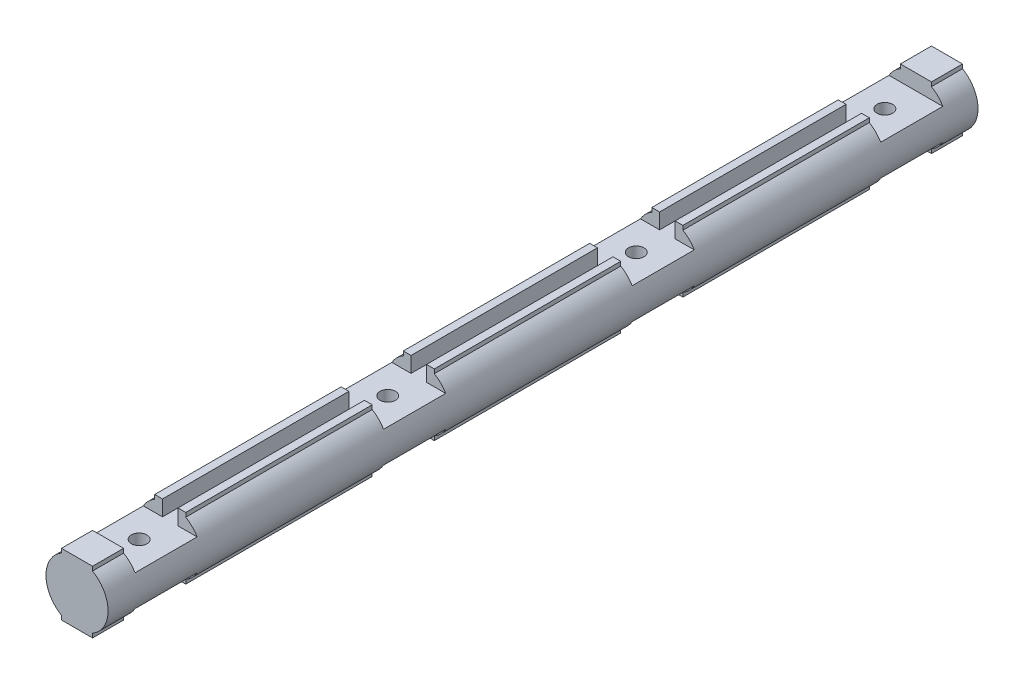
ISO-10303-21;
HEADER;
FILE_DESCRIPTION(('STEP AP214'),'2;1');
FILE_NAME('part.step','',(''),(''),'','','');
FILE_SCHEMA(('AUTOMOTIVE_DESIGN { 1 0 10303 214 1 1 1 1 }'));
ENDSEC;
DATA;
#1=APPLICATION_CONTEXT('core data for automotive mechanical design processes');
#2=APPLICATION_PROTOCOL_DEFINITION('international standard','automotive_design',2000,#1);
#3=PRODUCT_CONTEXT('',#1,'mechanical');
#4=PRODUCT('Part','Part','',(#3));
#5=PRODUCT_RELATED_PRODUCT_CATEGORY('part','',(#4));
#6=PRODUCT_DEFINITION_FORMATION('','',#4);
#7=PRODUCT_DEFINITION_CONTEXT('part definition',#1,'design');
#8=PRODUCT_DEFINITION('design','',#6,#7);
#9=PRODUCT_DEFINITION_SHAPE('','',#8);
#10=(LENGTH_UNIT() NAMED_UNIT(*) SI_UNIT(.MILLI.,.METRE.));
#11=(NAMED_UNIT(*) PLANE_ANGLE_UNIT() SI_UNIT($,.RADIAN.));
#12=(NAMED_UNIT(*) SI_UNIT($,.STERADIAN.) SOLID_ANGLE_UNIT());
#13=UNCERTAINTY_MEASURE_WITH_UNIT(LENGTH_MEASURE(1.E-05),#10,'distance_accuracy_value','');
#14=(GEOMETRIC_REPRESENTATION_CONTEXT(3) GLOBAL_UNCERTAINTY_ASSIGNED_CONTEXT((#13)) GLOBAL_UNIT_ASSIGNED_CONTEXT((#10,
#11,#12)) REPRESENTATION_CONTEXT('',''));
#15=CARTESIAN_POINT('',(0.,0.,0.));
#16=DIRECTION('',(0.,0.,1.));
#17=DIRECTION('',(1.,0.,0.));
#18=AXIS2_PLACEMENT_3D('',#15,#16,#17);
#19=CARTESIAN_POINT('',(0.,0.,140.));
#20=DIRECTION('',(0.,0.,-1.));
#21=DIRECTION('',(-1.,0.,0.));
#22=AXIS2_PLACEMENT_3D('',#19,#20,#21);
#23=CYLINDRICAL_SURFACE('',#22,10.);
#24=CARTESIAN_POINT('',(0.,0.,-130.));
#25=DIRECTION('',(0.,0.,-1.));
#26=DIRECTION('',(1.,0.,0.));
#27=AXIS2_PLACEMENT_3D('',#24,#25,#26);
#28=CIRCLE('',#27,10.);
#29=CARTESIAN_POINT('',(-5.,-8.66025403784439,-130.));
#30=VERTEX_POINT('',#29);
#31=CARTESIAN_POINT('',(-8.66025403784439,-5.,-130.));
#32=VERTEX_POINT('',#31);
#33=EDGE_CURVE('E670',#30,#32,#28,.T.);
#34=ORIENTED_EDGE('',*,*,#33,.T.);
#35=DIRECTION('',(0.,0.,1.));
#36=VECTOR('',#35,1.);
#37=CARTESIAN_POINT('',(-8.66025403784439,-5.,-130.));
#38=LINE('',#37,#36);
#39=CARTESIAN_POINT('',(-8.66025403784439,-5.,-110.));
#40=VERTEX_POINT('',#39);
#41=EDGE_CURVE('E614',#32,#40,#38,.T.);
#42=ORIENTED_EDGE('',*,*,#41,.T.);
#43=CARTESIAN_POINT('',(0.,0.,-110.));
#44=DIRECTION('',(0.,0.,-1.));
#45=DIRECTION('',(1.,0.,0.));
#46=AXIS2_PLACEMENT_3D('',#43,#44,#45);
#47=CIRCLE('',#46,10.);
#48=CARTESIAN_POINT('',(-5.,-8.66025403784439,-110.));
#49=VERTEX_POINT('',#48);
#50=EDGE_CURVE('E1058',#49,#40,#47,.T.);
#51=ORIENTED_EDGE('',*,*,#50,.F.);
#52=DIRECTION('',(0.,0.,-1.));
#53=VECTOR('',#52,1.);
#54=CARTESIAN_POINT('',(-5.,-8.66025403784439,140.));
#55=LINE('',#54,#53);
#56=CARTESIAN_POINT('',(-5.,-8.66025403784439,-50.));
#57=VERTEX_POINT('',#56);
#58=EDGE_CURVE('E943',#49,#57,#55,.F.);
#59=ORIENTED_EDGE('',*,*,#58,.T.);
#60=CARTESIAN_POINT('',(0.,0.,-50.));
#61=DIRECTION('',(0.,0.,-1.));
#62=DIRECTION('',(1.,0.,0.));
#63=AXIS2_PLACEMENT_3D('',#60,#61,#62);
#64=CIRCLE('',#63,10.);
#65=CARTESIAN_POINT('',(-8.66025403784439,-5.,-50.));
#66=VERTEX_POINT('',#65);
#67=EDGE_CURVE('E1153',#57,#66,#64,.T.);
#68=ORIENTED_EDGE('',*,*,#67,.T.);
#69=DIRECTION('',(0.,0.,1.));
#70=VECTOR('',#69,1.);
#71=CARTESIAN_POINT('',(-8.66025403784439,-5.,-50.));
#72=LINE('',#71,#70);
#73=CARTESIAN_POINT('',(-8.66025403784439,-5.,-30.));
#74=VERTEX_POINT('',#73);
#75=EDGE_CURVE('E605',#66,#74,#72,.T.);
#76=ORIENTED_EDGE('',*,*,#75,.T.);
#77=CARTESIAN_POINT('',(0.,0.,-30.));
#78=DIRECTION('',(0.,0.,-1.));
#79=DIRECTION('',(1.,0.,0.));
#80=AXIS2_PLACEMENT_3D('',#77,#78,#79);
#81=CIRCLE('',#80,10.);
#82=CARTESIAN_POINT('',(-5.,-8.66025403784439,-30.));
#83=VERTEX_POINT('',#82);
#84=EDGE_CURVE('E1216',#83,#74,#81,.T.);
#85=ORIENTED_EDGE('',*,*,#84,.F.);
#86=CARTESIAN_POINT('',(-5.,-8.66025403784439,30.));
#87=VERTEX_POINT('',#86);
#88=EDGE_CURVE('E1183',#83,#87,#55,.F.);
#89=ORIENTED_EDGE('',*,*,#88,.T.);
#90=CARTESIAN_POINT('',(0.,0.,30.));
#91=DIRECTION('',(0.,0.,-1.));
#92=DIRECTION('',(1.,0.,0.));
#93=AXIS2_PLACEMENT_3D('',#90,#91,#92);
#94=CIRCLE('',#93,10.);
#95=CARTESIAN_POINT('',(-8.66025403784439,-5.,30.));
#96=VERTEX_POINT('',#95);
#97=EDGE_CURVE('E48',#87,#96,#94,.T.);
#98=ORIENTED_EDGE('',*,*,#97,.T.);
#99=DIRECTION('',(0.,0.,1.));
#100=VECTOR('',#99,1.);
#101=CARTESIAN_POINT('',(-8.66025403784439,-5.,30.));
#102=LINE('',#101,#100);
#103=CARTESIAN_POINT('',(-8.66025403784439,-5.,50.));
#104=VERTEX_POINT('',#103);
#105=EDGE_CURVE('E601',#96,#104,#102,.T.);
#106=ORIENTED_EDGE('',*,*,#105,.T.);
#107=CARTESIAN_POINT('',(0.,0.,50.));
#108=DIRECTION('',(0.,0.,-1.));
#109=DIRECTION('',(1.,0.,0.));
#110=AXIS2_PLACEMENT_3D('',#107,#108,#109);
#111=CIRCLE('',#110,10.);
#112=CARTESIAN_POINT('',(-5.,-8.66025403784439,50.));
#113=VERTEX_POINT('',#112);
#114=EDGE_CURVE('E1091',#113,#104,#111,.T.);
#115=ORIENTED_EDGE('',*,*,#114,.F.);
#116=CARTESIAN_POINT('',(-5.,-8.66025403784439,110.));
#117=VERTEX_POINT('',#116);
#118=EDGE_CURVE('E1180',#113,#117,#55,.F.);
#119=ORIENTED_EDGE('',*,*,#118,.T.);
#120=CARTESIAN_POINT('',(0.,0.,110.));
#121=DIRECTION('',(0.,0.,-1.));
#122=DIRECTION('',(1.,0.,0.));
#123=AXIS2_PLACEMENT_3D('',#120,#121,#122);
#124=CIRCLE('',#123,10.);
#125=CARTESIAN_POINT('',(-8.66025403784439,-5.,110.));
#126=VERTEX_POINT('',#125);
#127=EDGE_CURVE('E1077',#117,#126,#124,.T.);
#128=ORIENTED_EDGE('',*,*,#127,.T.);
#129=DIRECTION('',(0.,0.,1.));
#130=VECTOR('',#129,1.);
#131=CARTESIAN_POINT('',(-8.66025403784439,-5.,110.));
#132=LINE('',#131,#130);
#133=CARTESIAN_POINT('',(-8.66025403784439,-5.,130.));
#134=VERTEX_POINT('',#133);
#135=EDGE_CURVE('E594',#126,#134,#132,.T.);
#136=ORIENTED_EDGE('',*,*,#135,.T.);
#137=CARTESIAN_POINT('',(0.,0.,130.));
#138=DIRECTION('',(0.,0.,-1.));
#139=DIRECTION('',(1.,0.,0.));
#140=AXIS2_PLACEMENT_3D('',#137,#138,#139);
#141=CIRCLE('',#140,10.);
#142=CARTESIAN_POINT('',(-5.,-8.66025403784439,130.));
#143=VERTEX_POINT('',#142);
#144=EDGE_CURVE('E1120',#143,#134,#141,.T.);
#145=ORIENTED_EDGE('',*,*,#144,.F.);
#146=CARTESIAN_POINT('',(-5.,-8.66025403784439,140.));
#147=VERTEX_POINT('',#146);
#148=EDGE_CURVE('E937',#143,#147,#55,.F.);
#149=ORIENTED_EDGE('',*,*,#148,.T.);
#150=CARTESIAN_POINT('',(0.,0.,140.));
#151=DIRECTION('',(0.,0.,1.));
#152=DIRECTION('',(1.,0.,0.));
#153=AXIS2_PLACEMENT_3D('',#150,#151,#152);
#154=CIRCLE('',#153,10.);
#155=CARTESIAN_POINT('',(-5.,8.66025403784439,140.));
#156=VERTEX_POINT('',#155);
#157=EDGE_CURVE('E952',#156,#147,#154,.T.);
#158=ORIENTED_EDGE('',*,*,#157,.F.);
#159=DIRECTION('',(0.,0.,-1.));
#160=VECTOR('',#159,1.);
#161=CARTESIAN_POINT('',(-5.,8.66025403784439,140.));
#162=LINE('',#161,#160);
#163=CARTESIAN_POINT('',(-5.,8.66025403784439,130.));
#164=VERTEX_POINT('',#163);
#165=EDGE_CURVE('E944',#156,#164,#162,.T.);
#166=ORIENTED_EDGE('',*,*,#165,.T.);
#167=CARTESIAN_POINT('',(0.,0.,130.));
#168=DIRECTION('',(0.,0.,1.));
#169=DIRECTION('',(1.,0.,0.));
#170=AXIS2_PLACEMENT_3D('',#167,#168,#169);
#171=CIRCLE('',#170,10.);
#172=CARTESIAN_POINT('',(-8.66025403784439,5.,130.));
#173=VERTEX_POINT('',#172);
#174=EDGE_CURVE('E727',#164,#173,#171,.T.);
#175=ORIENTED_EDGE('',*,*,#174,.T.);
#176=DIRECTION('',(0.,0.,1.));
#177=VECTOR('',#176,1.);
#178=CARTESIAN_POINT('',(-8.66025403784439,5.,110.));
#179=LINE('',#178,#177);
#180=CARTESIAN_POINT('',(-8.66025403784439,5.,110.));
#181=VERTEX_POINT('',#180);
#182=EDGE_CURVE('E711',#181,#173,#179,.T.);
#183=ORIENTED_EDGE('',*,*,#182,.F.);
#184=CARTESIAN_POINT('',(0.,0.,110.));
#185=DIRECTION('',(0.,0.,1.));
#186=DIRECTION('',(1.,0.,0.));
#187=AXIS2_PLACEMENT_3D('',#184,#185,#186);
#188=CIRCLE('',#187,10.);
#189=CARTESIAN_POINT('',(-5.,8.66025403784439,110.));
#190=VERTEX_POINT('',#189);
#191=EDGE_CURVE('E720',#190,#181,#188,.T.);
#192=ORIENTED_EDGE('',*,*,#191,.F.);
#193=CARTESIAN_POINT('',(-5.,8.66025403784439,50.));
#194=VERTEX_POINT('',#193);
#195=EDGE_CURVE('E948',#190,#194,#162,.T.);
#196=ORIENTED_EDGE('',*,*,#195,.T.);
#197=CARTESIAN_POINT('',(0.,0.,50.));
#198=DIRECTION('',(0.,0.,1.));
#199=DIRECTION('',(1.,0.,0.));
#200=AXIS2_PLACEMENT_3D('',#197,#198,#199);
#201=CIRCLE('',#200,10.);
#202=CARTESIAN_POINT('',(-8.66025403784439,5.,50.));
#203=VERTEX_POINT('',#202);
#204=EDGE_CURVE('E757',#194,#203,#201,.T.);
#205=ORIENTED_EDGE('',*,*,#204,.T.);
#206=DIRECTION('',(0.,0.,1.));
#207=VECTOR('',#206,1.);
#208=CARTESIAN_POINT('',(-8.66025403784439,5.,30.));
#209=LINE('',#208,#207);
#210=CARTESIAN_POINT('',(-8.66025403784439,5.,30.));
#211=VERTEX_POINT('',#210);
#212=EDGE_CURVE('E747',#211,#203,#209,.T.);
#213=ORIENTED_EDGE('',*,*,#212,.F.);
#214=CARTESIAN_POINT('',(0.,0.,30.));
#215=DIRECTION('',(0.,0.,1.));
#216=DIRECTION('',(1.,0.,0.));
#217=AXIS2_PLACEMENT_3D('',#214,#215,#216);
#218=CIRCLE('',#217,10.);
#219=CARTESIAN_POINT('',(-5.,8.66025403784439,30.));
#220=VERTEX_POINT('',#219);
#221=EDGE_CURVE('E770',#220,#211,#218,.T.);
#222=ORIENTED_EDGE('',*,*,#221,.F.);
#223=CARTESIAN_POINT('',(-5.,8.66025403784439,-30.));
#224=VERTEX_POINT('',#223);
#225=EDGE_CURVE('E1003',#220,#224,#162,.T.);
#226=ORIENTED_EDGE('',*,*,#225,.T.);
#227=CARTESIAN_POINT('',(0.,0.,-30.));
#228=DIRECTION('',(0.,0.,1.));
#229=DIRECTION('',(1.,0.,0.));
#230=AXIS2_PLACEMENT_3D('',#227,#228,#229);
#231=CIRCLE('',#230,10.);
#232=CARTESIAN_POINT('',(-8.66025403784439,5.,-30.));
#233=VERTEX_POINT('',#232);
#234=EDGE_CURVE('E801',#224,#233,#231,.T.);
#235=ORIENTED_EDGE('',*,*,#234,.T.);
#236=DIRECTION('',(0.,0.,1.));
#237=VECTOR('',#236,1.);
#238=CARTESIAN_POINT('',(-8.66025403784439,5.,-50.));
#239=LINE('',#238,#237);
#240=CARTESIAN_POINT('',(-8.66025403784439,5.,-50.));
#241=VERTEX_POINT('',#240);
#242=EDGE_CURVE('E790',#241,#233,#239,.T.);
#243=ORIENTED_EDGE('',*,*,#242,.F.);
#244=CARTESIAN_POINT('',(0.,0.,-50.));
#245=DIRECTION('',(0.,0.,1.));
#246=DIRECTION('',(1.,0.,0.));
#247=AXIS2_PLACEMENT_3D('',#244,#245,#246);
#248=CIRCLE('',#247,10.);
#249=CARTESIAN_POINT('',(-5.,8.66025403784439,-50.));
#250=VERTEX_POINT('',#249);
#251=EDGE_CURVE('E814',#250,#241,#248,.T.);
#252=ORIENTED_EDGE('',*,*,#251,.F.);
#253=CARTESIAN_POINT('',(-5.,8.66025403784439,-110.));
#254=VERTEX_POINT('',#253);
#255=EDGE_CURVE('E1004',#250,#254,#162,.T.);
#256=ORIENTED_EDGE('',*,*,#255,.T.);
#257=CARTESIAN_POINT('',(0.,0.,-110.));
#258=DIRECTION('',(0.,0.,1.));
#259=DIRECTION('',(1.,0.,0.));
#260=AXIS2_PLACEMENT_3D('',#257,#258,#259);
#261=CIRCLE('',#260,10.);
#262=CARTESIAN_POINT('',(-8.66025403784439,5.,-110.));
#263=VERTEX_POINT('',#262);
#264=EDGE_CURVE('E873',#254,#263,#261,.T.);
#265=ORIENTED_EDGE('',*,*,#264,.T.);
#266=DIRECTION('',(0.,0.,1.));
#267=VECTOR('',#266,1.);
#268=CARTESIAN_POINT('',(-8.66025403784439,5.,-130.));
#269=LINE('',#268,#267);
#270=CARTESIAN_POINT('',(-8.66025403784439,5.,-130.));
#271=VERTEX_POINT('',#270);
#272=EDGE_CURVE('E856',#271,#263,#269,.T.);
#273=ORIENTED_EDGE('',*,*,#272,.F.);
#274=CARTESIAN_POINT('',(0.,0.,-130.));
#275=DIRECTION('',(0.,0.,1.));
#276=DIRECTION('',(1.,0.,0.));
#277=AXIS2_PLACEMENT_3D('',#274,#275,#276);
#278=CIRCLE('',#277,10.);
#279=CARTESIAN_POINT('',(-5.,8.66025403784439,-130.));
#280=VERTEX_POINT('',#279);
#281=EDGE_CURVE('E881',#280,#271,#278,.T.);
#282=ORIENTED_EDGE('',*,*,#281,.F.);
#283=CARTESIAN_POINT('',(-5.,8.66025403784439,-140.));
#284=VERTEX_POINT('',#283);
#285=EDGE_CURVE('E942',#280,#284,#162,.T.);
#286=ORIENTED_EDGE('',*,*,#285,.T.);
#287=CARTESIAN_POINT('',(0.,0.,-140.));
#288=DIRECTION('',(0.,0.,1.));
#289=DIRECTION('',(1.,0.,0.));
#290=AXIS2_PLACEMENT_3D('',#287,#288,#289);
#291=CIRCLE('',#290,10.);
#292=CARTESIAN_POINT('',(-5.,-8.66025403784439,-140.));
#293=VERTEX_POINT('',#292);
#294=EDGE_CURVE('E953',#284,#293,#291,.T.);
#295=ORIENTED_EDGE('',*,*,#294,.T.);
#296=EDGE_CURVE('E939',#293,#30,#55,.F.);
#297=ORIENTED_EDGE('',*,*,#296,.T.);
#298=EDGE_LOOP('',(#34,#42,#51,#59,#68,#76,#85,#89,#98,#106,#115,#119,#128,#136,#145,#149,#158,
#166,#175,#183,#192,#196,#205,#213,#222,#226,#235,#243,#252,#256,#265,#273,#282,#286,#295,#297));
#299=FACE_BOUND('',#298,.T.);
#300=ADVANCED_FACE('F34',(#299),#23,.T.);
#301=DIRECTION('',(0.,0.,-1.));
#302=VECTOR('',#301,1.);
#303=CARTESIAN_POINT('',(5.,-8.66025403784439,140.));
#304=LINE('',#303,#302);
#305=CARTESIAN_POINT('',(5.,-8.66025403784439,140.));
#306=VERTEX_POINT('',#305);
#307=CARTESIAN_POINT('',(5.,-8.66025403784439,130.));
#308=VERTEX_POINT('',#307);
#309=EDGE_CURVE('E935',#306,#308,#304,.T.);
#310=ORIENTED_EDGE('',*,*,#309,.T.);
#311=CARTESIAN_POINT('',(0.,0.,130.));
#312=DIRECTION('',(0.,0.,-1.));
#313=DIRECTION('',(1.,0.,0.));
#314=AXIS2_PLACEMENT_3D('',#311,#312,#313);
#315=CIRCLE('',#314,10.);
#316=CARTESIAN_POINT('',(8.66025403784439,-5.,130.));
#317=VERTEX_POINT('',#316);
#318=EDGE_CURVE('E1118',#317,#308,#315,.T.);
#319=ORIENTED_EDGE('',*,*,#318,.F.);
#320=DIRECTION('',(0.,0.,1.));
#321=VECTOR('',#320,1.);
#322=CARTESIAN_POINT('',(8.66025403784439,-5.,110.));
#323=LINE('',#322,#321);
#324=CARTESIAN_POINT('',(8.66025403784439,-5.,110.));
#325=VERTEX_POINT('',#324);
#326=EDGE_CURVE('E589',#325,#317,#323,.T.);
#327=ORIENTED_EDGE('',*,*,#326,.F.);
#328=CARTESIAN_POINT('',(0.,0.,110.));
#329=DIRECTION('',(0.,0.,-1.));
#330=DIRECTION('',(1.,0.,0.));
#331=AXIS2_PLACEMENT_3D('',#328,#329,#330);
#332=CIRCLE('',#331,10.);
#333=CARTESIAN_POINT('',(5.,-8.66025403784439,110.));
#334=VERTEX_POINT('',#333);
#335=EDGE_CURVE('E1100',#325,#334,#332,.T.);
#336=ORIENTED_EDGE('',*,*,#335,.T.);
#337=CARTESIAN_POINT('',(5.,-8.66025403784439,50.));
#338=VERTEX_POINT('',#337);
#339=EDGE_CURVE('E938',#334,#338,#304,.T.);
#340=ORIENTED_EDGE('',*,*,#339,.T.);
#341=CARTESIAN_POINT('',(0.,0.,50.));
#342=DIRECTION('',(0.,0.,-1.));
#343=DIRECTION('',(1.,0.,0.));
#344=AXIS2_PLACEMENT_3D('',#341,#342,#343);
#345=CIRCLE('',#344,10.);
#346=CARTESIAN_POINT('',(8.66025403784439,-5.,50.));
#347=VERTEX_POINT('',#346);
#348=EDGE_CURVE('E1108',#347,#338,#345,.T.);
#349=ORIENTED_EDGE('',*,*,#348,.F.);
#350=DIRECTION('',(0.,0.,1.));
#351=VECTOR('',#350,1.);
#352=CARTESIAN_POINT('',(8.66025403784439,-5.,30.));
#353=LINE('',#352,#351);
#354=CARTESIAN_POINT('',(8.66025403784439,-5.,30.));
#355=VERTEX_POINT('',#354);
#356=EDGE_CURVE('E633',#355,#347,#353,.T.);
#357=ORIENTED_EDGE('',*,*,#356,.F.);
#358=CARTESIAN_POINT('',(0.,0.,30.));
#359=DIRECTION('',(0.,0.,-1.));
#360=DIRECTION('',(1.,0.,0.));
#361=AXIS2_PLACEMENT_3D('',#358,#359,#360);
#362=CIRCLE('',#361,10.);
#363=CARTESIAN_POINT('',(5.,-8.66025403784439,30.));
#364=VERTEX_POINT('',#363);
#365=EDGE_CURVE('E561',#355,#364,#362,.T.);
#366=ORIENTED_EDGE('',*,*,#365,.T.);
#367=CARTESIAN_POINT('',(5.,-8.66025403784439,-30.));
#368=VERTEX_POINT('',#367);
#369=EDGE_CURVE('E668',#364,#368,#304,.T.);
#370=ORIENTED_EDGE('',*,*,#369,.T.);
#371=CARTESIAN_POINT('',(0.,0.,-30.));
#372=DIRECTION('',(0.,0.,-1.));
#373=DIRECTION('',(1.,0.,0.));
#374=AXIS2_PLACEMENT_3D('',#371,#372,#373);
#375=CIRCLE('',#374,10.);
#376=CARTESIAN_POINT('',(8.66025403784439,-5.,-30.));
#377=VERTEX_POINT('',#376);
#378=EDGE_CURVE('E663',#377,#368,#375,.T.);
#379=ORIENTED_EDGE('',*,*,#378,.F.);
#380=DIRECTION('',(0.,0.,1.));
#381=VECTOR('',#380,1.);
#382=CARTESIAN_POINT('',(8.66025403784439,-5.,-50.));
#383=LINE('',#382,#381);
#384=CARTESIAN_POINT('',(8.66025403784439,-5.,-50.));
#385=VERTEX_POINT('',#384);
#386=EDGE_CURVE('E627',#385,#377,#383,.T.);
#387=ORIENTED_EDGE('',*,*,#386,.F.);
#388=CARTESIAN_POINT('',(0.,0.,-50.));
#389=DIRECTION('',(0.,0.,-1.));
#390=DIRECTION('',(1.,0.,0.));
#391=AXIS2_PLACEMENT_3D('',#388,#389,#390);
#392=CIRCLE('',#391,10.);
#393=CARTESIAN_POINT('',(5.,-8.66025403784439,-50.));
#394=VERTEX_POINT('',#393);
#395=EDGE_CURVE('E1133',#385,#394,#392,.T.);
#396=ORIENTED_EDGE('',*,*,#395,.T.);
#397=CARTESIAN_POINT('',(5.,-8.66025403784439,-110.));
#398=VERTEX_POINT('',#397);
#399=EDGE_CURVE('E1127',#394,#398,#304,.T.);
#400=ORIENTED_EDGE('',*,*,#399,.T.);
#401=CARTESIAN_POINT('',(0.,0.,-110.));
#402=DIRECTION('',(0.,0.,-1.));
#403=DIRECTION('',(1.,0.,0.));
#404=AXIS2_PLACEMENT_3D('',#401,#402,#403);
#405=CIRCLE('',#404,10.);
#406=CARTESIAN_POINT('',(8.66025403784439,-5.,-110.));
#407=VERTEX_POINT('',#406);
#408=EDGE_CURVE('E1132',#407,#398,#405,.T.);
#409=ORIENTED_EDGE('',*,*,#408,.F.);
#410=DIRECTION('',(0.,0.,1.));
#411=VECTOR('',#410,1.);
#412=CARTESIAN_POINT('',(8.66025403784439,-5.,-130.));
#413=LINE('',#412,#411);
#414=CARTESIAN_POINT('',(8.66025403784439,-5.,-130.));
#415=VERTEX_POINT('',#414);
#416=EDGE_CURVE('E619',#415,#407,#413,.T.);
#417=ORIENTED_EDGE('',*,*,#416,.F.);
#418=CARTESIAN_POINT('',(0.,0.,-130.));
#419=DIRECTION('',(0.,0.,-1.));
#420=DIRECTION('',(1.,0.,0.));
#421=AXIS2_PLACEMENT_3D('',#418,#419,#420);
#422=CIRCLE('',#421,10.);
#423=CARTESIAN_POINT('',(5.,-8.66025403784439,-130.));
#424=VERTEX_POINT('',#423);
#425=EDGE_CURVE('E673',#415,#424,#422,.T.);
#426=ORIENTED_EDGE('',*,*,#425,.T.);
#427=CARTESIAN_POINT('',(5.,-8.66025403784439,-140.));
#428=VERTEX_POINT('',#427);
#429=EDGE_CURVE('E933',#424,#428,#304,.T.);
#430=ORIENTED_EDGE('',*,*,#429,.T.);
#431=CARTESIAN_POINT('',(5.,8.66025403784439,-140.));
#432=VERTEX_POINT('',#431);
#433=EDGE_CURVE('E947',#428,#432,#291,.T.);
#434=ORIENTED_EDGE('',*,*,#433,.T.);
#435=DIRECTION('',(0.,0.,-1.));
#436=VECTOR('',#435,1.);
#437=CARTESIAN_POINT('',(5.,8.66025403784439,140.));
#438=LINE('',#437,#436);
#439=CARTESIAN_POINT('',(5.,8.66025403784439,-130.));
#440=VERTEX_POINT('',#439);
#441=EDGE_CURVE('E930',#432,#440,#438,.F.);
#442=ORIENTED_EDGE('',*,*,#441,.T.);
#443=CARTESIAN_POINT('',(0.,0.,-130.));
#444=DIRECTION('',(0.,0.,1.));
#445=DIRECTION('',(1.,0.,0.));
#446=AXIS2_PLACEMENT_3D('',#443,#444,#445);
#447=CIRCLE('',#446,10.);
#448=CARTESIAN_POINT('',(8.66025403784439,5.,-130.));
#449=VERTEX_POINT('',#448);
#450=EDGE_CURVE('E876',#449,#440,#447,.T.);
#451=ORIENTED_EDGE('',*,*,#450,.F.);
#452=DIRECTION('',(0.,0.,1.));
#453=VECTOR('',#452,1.);
#454=CARTESIAN_POINT('',(8.66025403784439,5.,-130.));
#455=LINE('',#454,#453);
#456=CARTESIAN_POINT('',(8.66025403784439,5.,-110.));
#457=VERTEX_POINT('',#456);
#458=EDGE_CURVE('E863',#449,#457,#455,.T.);
#459=ORIENTED_EDGE('',*,*,#458,.T.);
#460=CARTESIAN_POINT('',(0.,0.,-110.));
#461=DIRECTION('',(0.,0.,1.));
#462=DIRECTION('',(1.,0.,0.));
#463=AXIS2_PLACEMENT_3D('',#460,#461,#462);
#464=CIRCLE('',#463,10.);
#465=CARTESIAN_POINT('',(5.,8.66025403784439,-110.));
#466=VERTEX_POINT('',#465);
#467=EDGE_CURVE('E866',#457,#466,#464,.T.);
#468=ORIENTED_EDGE('',*,*,#467,.T.);
#469=CARTESIAN_POINT('',(5.,8.66025403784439,-50.));
#470=VERTEX_POINT('',#469);
#471=EDGE_CURVE('E934',#466,#470,#438,.F.);
#472=ORIENTED_EDGE('',*,*,#471,.T.);
#473=CARTESIAN_POINT('',(0.,0.,-50.));
#474=DIRECTION('',(0.,0.,1.));
#475=DIRECTION('',(1.,0.,0.));
#476=AXIS2_PLACEMENT_3D('',#473,#474,#475);
#477=CIRCLE('',#476,10.);
#478=CARTESIAN_POINT('',(8.66025403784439,5.,-50.));
#479=VERTEX_POINT('',#478);
#480=EDGE_CURVE('E809',#479,#470,#477,.T.);
#481=ORIENTED_EDGE('',*,*,#480,.F.);
#482=DIRECTION('',(0.,0.,1.));
#483=VECTOR('',#482,1.);
#484=CARTESIAN_POINT('',(8.66025403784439,5.,-50.));
#485=LINE('',#484,#483);
#486=CARTESIAN_POINT('',(8.66025403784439,5.,-30.));
#487=VERTEX_POINT('',#486);
#488=EDGE_CURVE('E786',#479,#487,#485,.T.);
#489=ORIENTED_EDGE('',*,*,#488,.T.);
#490=CARTESIAN_POINT('',(0.,0.,-30.));
#491=DIRECTION('',(0.,0.,1.));
#492=DIRECTION('',(1.,0.,0.));
#493=AXIS2_PLACEMENT_3D('',#490,#491,#492);
#494=CIRCLE('',#493,10.);
#495=CARTESIAN_POINT('',(5.,8.66025403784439,-30.));
#496=VERTEX_POINT('',#495);
#497=EDGE_CURVE('E796',#487,#496,#494,.T.);
#498=ORIENTED_EDGE('',*,*,#497,.T.);
#499=CARTESIAN_POINT('',(5.,8.66025403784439,30.));
#500=VERTEX_POINT('',#499);
#501=EDGE_CURVE('E1483',#496,#500,#438,.F.);
#502=ORIENTED_EDGE('',*,*,#501,.T.);
#503=CARTESIAN_POINT('',(0.,0.,30.));
#504=DIRECTION('',(0.,0.,1.));
#505=DIRECTION('',(1.,0.,0.));
#506=AXIS2_PLACEMENT_3D('',#503,#504,#505);
#507=CIRCLE('',#506,10.);
#508=CARTESIAN_POINT('',(8.66025403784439,5.,30.));
#509=VERTEX_POINT('',#508);
#510=EDGE_CURVE('E765',#509,#500,#507,.T.);
#511=ORIENTED_EDGE('',*,*,#510,.F.);
#512=DIRECTION('',(0.,0.,1.));
#513=VECTOR('',#512,1.);
#514=CARTESIAN_POINT('',(8.66025403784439,5.,30.));
#515=LINE('',#514,#513);
#516=CARTESIAN_POINT('',(8.66025403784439,5.,50.));
#517=VERTEX_POINT('',#516);
#518=EDGE_CURVE('E743',#509,#517,#515,.T.);
#519=ORIENTED_EDGE('',*,*,#518,.T.);
#520=CARTESIAN_POINT('',(0.,0.,50.));
#521=DIRECTION('',(0.,0.,1.));
#522=DIRECTION('',(1.,0.,0.));
#523=AXIS2_PLACEMENT_3D('',#520,#521,#522);
#524=CIRCLE('',#523,10.);
#525=CARTESIAN_POINT('',(5.,8.66025403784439,50.));
#526=VERTEX_POINT('',#525);
#527=EDGE_CURVE('E752',#517,#526,#524,.T.);
#528=ORIENTED_EDGE('',*,*,#527,.T.);
#529=CARTESIAN_POINT('',(5.,8.66025403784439,110.));
#530=VERTEX_POINT('',#529);
#531=EDGE_CURVE('E1485',#526,#530,#438,.F.);
#532=ORIENTED_EDGE('',*,*,#531,.T.);
#533=CARTESIAN_POINT('',(0.,0.,110.));
#534=DIRECTION('',(0.,0.,1.));
#535=DIRECTION('',(1.,0.,0.));
#536=AXIS2_PLACEMENT_3D('',#533,#534,#535);
#537=CIRCLE('',#536,10.);
#538=CARTESIAN_POINT('',(8.66025403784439,5.,110.));
#539=VERTEX_POINT('',#538);
#540=EDGE_CURVE('E715',#539,#530,#537,.T.);
#541=ORIENTED_EDGE('',*,*,#540,.F.);
#542=DIRECTION('',(0.,0.,1.));
#543=VECTOR('',#542,1.);
#544=CARTESIAN_POINT('',(8.66025403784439,5.,110.));
#545=LINE('',#544,#543);
#546=CARTESIAN_POINT('',(8.66025403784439,5.,130.));
#547=VERTEX_POINT('',#546);
#548=EDGE_CURVE('E707',#539,#547,#545,.T.);
#549=ORIENTED_EDGE('',*,*,#548,.T.);
#550=CARTESIAN_POINT('',(0.,0.,130.));
#551=DIRECTION('',(0.,0.,1.));
#552=DIRECTION('',(1.,0.,0.));
#553=AXIS2_PLACEMENT_3D('',#550,#551,#552);
#554=CIRCLE('',#553,10.);
#555=CARTESIAN_POINT('',(5.,8.66025403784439,130.));
#556=VERTEX_POINT('',#555);
#557=EDGE_CURVE('E722',#547,#556,#554,.T.);
#558=ORIENTED_EDGE('',*,*,#557,.T.);
#559=CARTESIAN_POINT('',(5.,8.66025403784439,140.));
#560=VERTEX_POINT('',#559);
#561=EDGE_CURVE('E929',#556,#560,#438,.F.);
#562=ORIENTED_EDGE('',*,*,#561,.T.);
#563=EDGE_CURVE('E949',#306,#560,#154,.T.);
#564=ORIENTED_EDGE('',*,*,#563,.F.);
#565=EDGE_LOOP('',(#310,#319,#327,#336,#340,#349,#357,#366,#370,#379,#387,#396,#400,#409,#417,
#426,#430,#434,#442,#451,#459,#468,#472,#481,#489,#498,#502,#511,#519,#528,#532,#541,#549,#558,
#562,#564));
#566=FACE_BOUND('',#565,.T.);
#567=ADVANCED_FACE('F665',(#566),#23,.T.);
#568=CARTESIAN_POINT('',(5.,-10.,-162.360679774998));
#569=DIRECTION('',(1.,0.,0.));
#570=DIRECTION('',(0.,0.,-1.));
#571=AXIS2_PLACEMENT_3D('',#568,#569,#570);
#572=PLANE('',#571);
#573=ORIENTED_EDGE('',*,*,#429,.F.);
#574=DIRECTION('',(0.,1.,0.));
#575=VECTOR('',#574,1.);
#576=CARTESIAN_POINT('',(5.,10.,-130.));
#577=LINE('',#576,#575);
#578=CARTESIAN_POINT('',(5.,-10.,-130.));
#579=VERTEX_POINT('',#578);
#580=EDGE_CURVE('E679',#579,#424,#577,.T.);
#581=ORIENTED_EDGE('',*,*,#580,.F.);
#582=DIRECTION('',(0.,0.,1.));
#583=VECTOR('',#582,1.);
#584=CARTESIAN_POINT('',(5.,-10.,-162.360679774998));
#585=LINE('',#584,#583);
#586=CARTESIAN_POINT('',(5.,-10.,-140.));
#587=VERTEX_POINT('',#586);
#588=EDGE_CURVE('E919',#587,#579,#585,.T.);
#589=ORIENTED_EDGE('',*,*,#588,.F.);
#590=DIRECTION('',(0.,-1.,0.));
#591=VECTOR('',#590,1.);
#592=CARTESIAN_POINT('',(5.,-10.,-140.));
#593=LINE('',#592,#591);
#594=EDGE_CURVE('E888',#428,#587,#593,.T.);
#595=ORIENTED_EDGE('',*,*,#594,.F.);
#596=EDGE_LOOP('',(#573,#581,#589,#595));
#597=FACE_BOUND('',#596,.T.);
#598=ADVANCED_FACE('F1039',(#597),#572,.T.);
#599=DIRECTION('',(0.,1.,0.));
#600=VECTOR('',#599,1.);
#601=CARTESIAN_POINT('',(5.,10.,-30.));
#602=LINE('',#601,#600);
#603=CARTESIAN_POINT('',(5.,-10.,-30.));
#604=VERTEX_POINT('',#603);
#605=EDGE_CURVE('E558',#604,#368,#602,.T.);
#606=ORIENTED_EDGE('',*,*,#605,.T.);
#607=ORIENTED_EDGE('',*,*,#369,.F.);
#608=DIRECTION('',(0.,1.,0.));
#609=VECTOR('',#608,1.);
#610=CARTESIAN_POINT('',(5.,10.,30.));
#611=LINE('',#610,#609);
#612=CARTESIAN_POINT('',(5.,-10.,30.));
#613=VERTEX_POINT('',#612);
#614=EDGE_CURVE('E555',#613,#364,#611,.T.);
#615=ORIENTED_EDGE('',*,*,#614,.F.);
#616=EDGE_CURVE('E553',#604,#613,#585,.T.);
#617=ORIENTED_EDGE('',*,*,#616,.F.);
#618=EDGE_LOOP('',(#606,#607,#615,#617));
#619=FACE_BOUND('',#618,.T.);
#620=ADVANCED_FACE('F1126',(#619),#572,.T.);
#621=DIRECTION('',(0.,1.,0.));
#622=VECTOR('',#621,1.);
#623=CARTESIAN_POINT('',(5.,10.,50.));
#624=LINE('',#623,#622);
#625=CARTESIAN_POINT('',(5.,-10.,50.));
#626=VERTEX_POINT('',#625);
#627=EDGE_CURVE('E1105',#626,#338,#624,.T.);
#628=ORIENTED_EDGE('',*,*,#627,.T.);
#629=ORIENTED_EDGE('',*,*,#339,.F.);
#630=DIRECTION('',(0.,1.,0.));
#631=VECTOR('',#630,1.);
#632=CARTESIAN_POINT('',(5.,10.,110.));
#633=LINE('',#632,#631);
#634=CARTESIAN_POINT('',(5.,-10.,110.));
#635=VERTEX_POINT('',#634);
#636=EDGE_CURVE('E1103',#635,#334,#633,.T.);
#637=ORIENTED_EDGE('',*,*,#636,.F.);
#638=EDGE_CURVE('E1246',#626,#635,#585,.T.);
#639=ORIENTED_EDGE('',*,*,#638,.F.);
#640=EDGE_LOOP('',(#628,#629,#637,#639));
#641=FACE_BOUND('',#640,.T.);
#642=ADVANCED_FACE('F1294',(#641),#572,.T.);
#643=DIRECTION('',(0.,1.,0.));
#644=VECTOR('',#643,1.);
#645=CARTESIAN_POINT('',(5.,10.,-110.));
#646=LINE('',#645,#644);
#647=CARTESIAN_POINT('',(5.,-10.,-110.));
#648=VERTEX_POINT('',#647);
#649=EDGE_CURVE('E1141',#648,#398,#646,.T.);
#650=ORIENTED_EDGE('',*,*,#649,.T.);
#651=ORIENTED_EDGE('',*,*,#399,.F.);
#652=DIRECTION('',(0.,1.,0.));
#653=VECTOR('',#652,1.);
#654=CARTESIAN_POINT('',(5.,10.,-50.));
#655=LINE('',#654,#653);
#656=CARTESIAN_POINT('',(5.,-10.,-50.));
#657=VERTEX_POINT('',#656);
#658=EDGE_CURVE('E1139',#657,#394,#655,.T.);
#659=ORIENTED_EDGE('',*,*,#658,.F.);
#660=EDGE_CURVE('E922',#648,#657,#585,.T.);
#661=ORIENTED_EDGE('',*,*,#660,.F.);
#662=EDGE_LOOP('',(#650,#651,#659,#661));
#663=FACE_BOUND('',#662,.T.);
#664=ADVANCED_FACE('F1137',(#663),#572,.T.);
#665=CARTESIAN_POINT('',(5.,-10.,-162.360679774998));
#666=DIRECTION('',(0.,-1.,0.));
#667=DIRECTION('',(0.,0.,-1.));
#668=AXIS2_PLACEMENT_3D('',#665,#666,#667);
#669=PLANE('',#668);
#670=ORIENTED_EDGE('',*,*,#588,.T.);
#671=DIRECTION('',(-1.,0.,0.));
#672=VECTOR('',#671,1.);
#673=CARTESIAN_POINT('',(8.66025403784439,-10.,-130.));
#674=LINE('',#673,#672);
#675=CARTESIAN_POINT('',(-5.,-10.,-130.));
#676=VERTEX_POINT('',#675);
#677=EDGE_CURVE('E681',#579,#676,#674,.T.);
#678=ORIENTED_EDGE('',*,*,#677,.T.);
#679=DIRECTION('',(0.,0.,1.));
#680=VECTOR('',#679,1.);
#681=CARTESIAN_POINT('',(-5.,-10.,-162.360679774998));
#682=LINE('',#681,#680);
#683=CARTESIAN_POINT('',(-5.,-10.,-140.));
#684=VERTEX_POINT('',#683);
#685=EDGE_CURVE('E924',#684,#676,#682,.T.);
#686=ORIENTED_EDGE('',*,*,#685,.F.);
#687=DIRECTION('',(-1.,0.,0.));
#688=VECTOR('',#687,1.);
#689=CARTESIAN_POINT('',(5.,-10.,-140.));
#690=LINE('',#689,#688);
#691=EDGE_CURVE('E894',#587,#684,#690,.T.);
#692=ORIENTED_EDGE('',*,*,#691,.F.);
#693=EDGE_LOOP('',(#670,#678,#686,#692));
#694=FACE_BOUND('',#693,.T.);
#695=ADVANCED_FACE('F1042',(#694),#669,.T.);
#696=DIRECTION('',(-1.,0.,0.));
#697=VECTOR('',#696,1.);
#698=CARTESIAN_POINT('',(8.66025403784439,-10.,130.));
#699=LINE('',#698,#697);
#700=CARTESIAN_POINT('',(5.,-10.,130.));
#701=VERTEX_POINT('',#700);
#702=CARTESIAN_POINT('',(-5.,-10.,130.));
#703=VERTEX_POINT('',#702);
#704=EDGE_CURVE('E1113',#701,#703,#699,.T.);
#705=ORIENTED_EDGE('',*,*,#704,.F.);
#706=CARTESIAN_POINT('',(5.,-10.,140.));
#707=VERTEX_POINT('',#706);
#708=EDGE_CURVE('E923',#701,#707,#585,.T.);
#709=ORIENTED_EDGE('',*,*,#708,.T.);
#710=DIRECTION('',(1.,0.,0.));
#711=VECTOR('',#710,1.);
#712=CARTESIAN_POINT('',(5.,-10.,140.));
#713=LINE('',#712,#711);
#714=CARTESIAN_POINT('',(-5.,-10.,140.));
#715=VERTEX_POINT('',#714);
#716=EDGE_CURVE('E898',#715,#707,#713,.T.);
#717=ORIENTED_EDGE('',*,*,#716,.F.);
#718=EDGE_CURVE('E908',#703,#715,#682,.T.);
#719=ORIENTED_EDGE('',*,*,#718,.F.);
#720=EDGE_LOOP('',(#705,#709,#717,#719));
#721=FACE_BOUND('',#720,.T.);
#722=ADVANCED_FACE('F1241',(#721),#669,.T.);
#723=DIRECTION('',(-1.,0.,0.));
#724=VECTOR('',#723,1.);
#725=CARTESIAN_POINT('',(8.66025403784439,-10.,50.));
#726=LINE('',#725,#724);
#727=CARTESIAN_POINT('',(2.5,-10.,50.));
#728=VERTEX_POINT('',#727);
#729=EDGE_CURVE('E1092',#626,#728,#726,.T.);
#730=ORIENTED_EDGE('',*,*,#729,.F.);
#731=ORIENTED_EDGE('',*,*,#638,.T.);
#732=DIRECTION('',(-1.,0.,0.));
#733=VECTOR('',#732,1.);
#734=CARTESIAN_POINT('',(8.66025403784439,-10.,110.));
#735=LINE('',#734,#733);
#736=CARTESIAN_POINT('',(2.5,-10.,110.));
#737=VERTEX_POINT('',#736);
#738=EDGE_CURVE('E1084',#635,#737,#735,.T.);
#739=ORIENTED_EDGE('',*,*,#738,.T.);
#740=DIRECTION('',(0.,0.,-1.));
#741=VECTOR('',#740,1.);
#742=CARTESIAN_POINT('',(2.5,-10.,110.));
#743=LINE('',#742,#741);
#744=EDGE_CURVE('E548',#737,#728,#743,.T.);
#745=ORIENTED_EDGE('',*,*,#744,.T.);
#746=EDGE_LOOP('',(#730,#731,#739,#745));
#747=FACE_BOUND('',#746,.T.);
#748=ADVANCED_FACE('F1386',(#747),#669,.T.);
#749=CARTESIAN_POINT('',(-2.5,-10.,50.));
#750=VERTEX_POINT('',#749);
#751=CARTESIAN_POINT('',(-5.,-10.,50.));
#752=VERTEX_POINT('',#751);
#753=EDGE_CURVE('E1089',#750,#752,#726,.T.);
#754=ORIENTED_EDGE('',*,*,#753,.F.);
#755=DIRECTION('',(0.,0.,1.));
#756=VECTOR('',#755,1.);
#757=CARTESIAN_POINT('',(-2.5,-10.,110.));
#758=LINE('',#757,#756);
#759=CARTESIAN_POINT('',(-2.5,-10.,110.));
#760=VERTEX_POINT('',#759);
#761=EDGE_CURVE('E579',#750,#760,#758,.T.);
#762=ORIENTED_EDGE('',*,*,#761,.T.);
#763=CARTESIAN_POINT('',(-5.,-10.,110.));
#764=VERTEX_POINT('',#763);
#765=EDGE_CURVE('E1080',#760,#764,#735,.T.);
#766=ORIENTED_EDGE('',*,*,#765,.T.);
#767=EDGE_CURVE('E1181',#752,#764,#682,.T.);
#768=ORIENTED_EDGE('',*,*,#767,.F.);
#769=EDGE_LOOP('',(#754,#762,#766,#768));
#770=FACE_BOUND('',#769,.T.);
#771=ADVANCED_FACE('F1165',(#770),#669,.T.);
#772=DIRECTION('',(-1.,0.,0.));
#773=VECTOR('',#772,1.);
#774=CARTESIAN_POINT('',(8.66025403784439,-10.,-110.));
#775=LINE('',#774,#773);
#776=CARTESIAN_POINT('',(-2.5,-10.,-110.));
#777=VERTEX_POINT('',#776);
#778=CARTESIAN_POINT('',(-5.,-10.,-110.));
#779=VERTEX_POINT('',#778);
#780=EDGE_CURVE('E1064',#777,#779,#775,.T.);
#781=ORIENTED_EDGE('',*,*,#780,.F.);
#782=CARTESIAN_POINT('',(-2.5,-10.,-50.));
#783=VERTEX_POINT('',#782);
#784=EDGE_CURVE('E580',#777,#783,#758,.T.);
#785=ORIENTED_EDGE('',*,*,#784,.T.);
#786=DIRECTION('',(-1.,0.,0.));
#787=VECTOR('',#786,1.);
#788=CARTESIAN_POINT('',(8.66025403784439,-10.,-50.));
#789=LINE('',#788,#787);
#790=CARTESIAN_POINT('',(-5.,-10.,-50.));
#791=VERTEX_POINT('',#790);
#792=EDGE_CURVE('E1155',#783,#791,#789,.T.);
#793=ORIENTED_EDGE('',*,*,#792,.T.);
#794=EDGE_CURVE('E927',#779,#791,#682,.T.);
#795=ORIENTED_EDGE('',*,*,#794,.F.);
#796=EDGE_LOOP('',(#781,#785,#793,#795));
#797=FACE_BOUND('',#796,.T.);
#798=ADVANCED_FACE('F1207',(#797),#669,.T.);
#799=CARTESIAN_POINT('',(2.5,-10.,-110.));
#800=VERTEX_POINT('',#799);
#801=EDGE_CURVE('E1070',#648,#800,#775,.T.);
#802=ORIENTED_EDGE('',*,*,#801,.F.);
#803=ORIENTED_EDGE('',*,*,#660,.T.);
#804=CARTESIAN_POINT('',(2.5,-10.,-50.));
#805=VERTEX_POINT('',#804);
#806=EDGE_CURVE('E1148',#657,#805,#789,.T.);
#807=ORIENTED_EDGE('',*,*,#806,.T.);
#808=EDGE_CURVE('E549',#805,#800,#743,.T.);
#809=ORIENTED_EDGE('',*,*,#808,.T.);
#810=EDGE_LOOP('',(#802,#803,#807,#809));
#811=FACE_BOUND('',#810,.T.);
#812=ADVANCED_FACE('F1254',(#811),#669,.T.);
#813=DIRECTION('',(-1.,0.,0.));
#814=VECTOR('',#813,1.);
#815=CARTESIAN_POINT('',(8.66025403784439,-10.,-30.));
#816=LINE('',#815,#814);
#817=CARTESIAN_POINT('',(-2.5,-10.,-30.));
#818=VERTEX_POINT('',#817);
#819=CARTESIAN_POINT('',(-5.,-10.,-30.));
#820=VERTEX_POINT('',#819);
#821=EDGE_CURVE('E560',#818,#820,#816,.T.);
#822=ORIENTED_EDGE('',*,*,#821,.F.);
#823=CARTESIAN_POINT('',(-2.5,-10.,30.));
#824=VERTEX_POINT('',#823);
#825=EDGE_CURVE('E573',#818,#824,#758,.T.);
#826=ORIENTED_EDGE('',*,*,#825,.T.);
#827=DIRECTION('',(-1.,0.,0.));
#828=VECTOR('',#827,1.);
#829=CARTESIAN_POINT('',(8.66025403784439,-10.,30.));
#830=LINE('',#829,#828);
#831=CARTESIAN_POINT('',(-5.,-10.,30.));
#832=VERTEX_POINT('',#831);
#833=EDGE_CURVE('E557',#824,#832,#830,.T.);
#834=ORIENTED_EDGE('',*,*,#833,.T.);
#835=EDGE_CURVE('E1199',#820,#832,#682,.T.);
#836=ORIENTED_EDGE('',*,*,#835,.F.);
#837=EDGE_LOOP('',(#822,#826,#834,#836));
#838=FACE_BOUND('',#837,.T.);
#839=ADVANCED_FACE('F1227',(#838),#669,.T.);
#840=CARTESIAN_POINT('',(-5.,-10.,-162.360679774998));
#841=DIRECTION('',(-1.,0.,0.));
#842=DIRECTION('',(0.,0.,1.));
#843=AXIS2_PLACEMENT_3D('',#840,#841,#842);
#844=PLANE('',#843);
#845=ORIENTED_EDGE('',*,*,#685,.T.);
#846=DIRECTION('',(0.,-1.,0.));
#847=VECTOR('',#846,1.);
#848=CARTESIAN_POINT('',(-5.,10.,-130.));
#849=LINE('',#848,#847);
#850=EDGE_CURVE('E684',#30,#676,#849,.T.);
#851=ORIENTED_EDGE('',*,*,#850,.F.);
#852=ORIENTED_EDGE('',*,*,#296,.F.);
#853=DIRECTION('',(0.,1.,0.));
#854=VECTOR('',#853,1.);
#855=CARTESIAN_POINT('',(-5.,-10.,-140.));
#856=LINE('',#855,#854);
#857=EDGE_CURVE('E891',#684,#293,#856,.T.);
#858=ORIENTED_EDGE('',*,*,#857,.F.);
#859=EDGE_LOOP('',(#845,#851,#852,#858));
#860=FACE_BOUND('',#859,.T.);
#861=ADVANCED_FACE('F1045',(#860),#844,.T.);
#862=DIRECTION('',(0.,-1.,0.));
#863=VECTOR('',#862,1.);
#864=CARTESIAN_POINT('',(-5.,10.,50.));
#865=LINE('',#864,#863);
#866=EDGE_CURVE('E1086',#113,#752,#865,.T.);
#867=ORIENTED_EDGE('',*,*,#866,.T.);
#868=ORIENTED_EDGE('',*,*,#767,.T.);
#869=DIRECTION('',(0.,-1.,0.));
#870=VECTOR('',#869,1.);
#871=CARTESIAN_POINT('',(-5.,10.,110.));
#872=LINE('',#871,#870);
#873=EDGE_CURVE('E1083',#117,#764,#872,.T.);
#874=ORIENTED_EDGE('',*,*,#873,.F.);
#875=ORIENTED_EDGE('',*,*,#118,.F.);
#876=EDGE_LOOP('',(#867,#868,#874,#875));
#877=FACE_BOUND('',#876,.T.);
#878=ADVANCED_FACE('F1179',(#877),#844,.T.);
#879=DIRECTION('',(0.,-1.,0.));
#880=VECTOR('',#879,1.);
#881=CARTESIAN_POINT('',(-5.,10.,-110.));
#882=LINE('',#881,#880);
#883=EDGE_CURVE('E1061',#49,#779,#882,.T.);
#884=ORIENTED_EDGE('',*,*,#883,.T.);
#885=ORIENTED_EDGE('',*,*,#794,.T.);
#886=DIRECTION('',(0.,-1.,0.));
#887=VECTOR('',#886,1.);
#888=CARTESIAN_POINT('',(-5.,10.,-50.));
#889=LINE('',#888,#887);
#890=EDGE_CURVE('E1068',#57,#791,#889,.T.);
#891=ORIENTED_EDGE('',*,*,#890,.F.);
#892=ORIENTED_EDGE('',*,*,#58,.F.);
#893=EDGE_LOOP('',(#884,#885,#891,#892));
#894=FACE_BOUND('',#893,.T.);
#895=ADVANCED_FACE('F1206',(#894),#844,.T.);
#896=DIRECTION('',(0.,-1.,0.));
#897=VECTOR('',#896,1.);
#898=CARTESIAN_POINT('',(-5.,10.,-30.));
#899=LINE('',#898,#897);
#900=EDGE_CURVE('E572',#83,#820,#899,.T.);
#901=ORIENTED_EDGE('',*,*,#900,.T.);
#902=ORIENTED_EDGE('',*,*,#835,.T.);
#903=DIRECTION('',(0.,-1.,0.));
#904=VECTOR('',#903,1.);
#905=CARTESIAN_POINT('',(-5.,10.,30.));
#906=LINE('',#905,#904);
#907=EDGE_CURVE('E566',#87,#832,#906,.T.);
#908=ORIENTED_EDGE('',*,*,#907,.F.);
#909=ORIENTED_EDGE('',*,*,#88,.F.);
#910=EDGE_LOOP('',(#901,#902,#908,#909));
#911=FACE_BOUND('',#910,.T.);
#912=ADVANCED_FACE('F1221',(#911),#844,.T.);
#913=ORIENTED_EDGE('',*,*,#195,.F.);
#914=DIRECTION('',(0.,1.,0.));
#915=VECTOR('',#914,1.);
#916=CARTESIAN_POINT('',(-5.,-10.,110.));
#917=LINE('',#916,#915);
#918=CARTESIAN_POINT('',(-5.,10.,110.));
#919=VERTEX_POINT('',#918);
#920=EDGE_CURVE('E717',#190,#919,#917,.T.);
#921=ORIENTED_EDGE('',*,*,#920,.T.);
#922=DIRECTION('',(0.,0.,1.));
#923=VECTOR('',#922,1.);
#924=CARTESIAN_POINT('',(-5.,10.,-162.360679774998));
#925=LINE('',#924,#923);
#926=CARTESIAN_POINT('',(-5.,10.,50.));
#927=VERTEX_POINT('',#926);
#928=EDGE_CURVE('E994',#927,#919,#925,.T.);
#929=ORIENTED_EDGE('',*,*,#928,.F.);
#930=DIRECTION('',(0.,1.,0.));
#931=VECTOR('',#930,1.);
#932=CARTESIAN_POINT('',(-5.,-10.,50.));
#933=LINE('',#932,#931);
#934=EDGE_CURVE('E755',#194,#927,#933,.T.);
#935=ORIENTED_EDGE('',*,*,#934,.F.);
#936=EDGE_LOOP('',(#913,#921,#929,#935));
#937=FACE_BOUND('',#936,.T.);
#938=ADVANCED_FACE('F1000',(#937),#844,.T.);
#939=CARTESIAN_POINT('',(5.,10.,-162.360679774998));
#940=DIRECTION('',(0.,1.,0.));
#941=DIRECTION('',(0.,0.,1.));
#942=AXIS2_PLACEMENT_3D('',#939,#940,#941);
#943=PLANE('',#942);
#944=ORIENTED_EDGE('',*,*,#928,.T.);
#945=DIRECTION('',(-1.,0.,0.));
#946=VECTOR('',#945,1.);
#947=CARTESIAN_POINT('',(8.66025403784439,10.,110.));
#948=LINE('',#947,#946);
#949=CARTESIAN_POINT('',(-2.5,10.,110.));
#950=VERTEX_POINT('',#949);
#951=EDGE_CURVE('E698',#950,#919,#948,.T.);
#952=ORIENTED_EDGE('',*,*,#951,.F.);
#953=DIRECTION('',(0.,0.,1.));
#954=VECTOR('',#953,1.);
#955=CARTESIAN_POINT('',(-2.5,10.,110.));
#956=LINE('',#955,#954);
#957=CARTESIAN_POINT('',(-2.5,10.,50.));
#958=VERTEX_POINT('',#957);
#959=EDGE_CURVE('E816',#958,#950,#956,.T.);
#960=ORIENTED_EDGE('',*,*,#959,.F.);
#961=DIRECTION('',(-1.,0.,0.));
#962=VECTOR('',#961,1.);
#963=CARTESIAN_POINT('',(8.66025403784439,10.,50.));
#964=LINE('',#963,#962);
#965=EDGE_CURVE('E739',#958,#927,#964,.T.);
#966=ORIENTED_EDGE('',*,*,#965,.T.);
#967=EDGE_LOOP('',(#944,#952,#960,#966));
#968=FACE_BOUND('',#967,.T.);
#969=ADVANCED_FACE('F992',(#968),#943,.T.);
#970=DIRECTION('',(0.,0.,-1.));
#971=VECTOR('',#970,1.);
#972=CARTESIAN_POINT('',(2.5,10.,110.));
#973=LINE('',#972,#971);
#974=CARTESIAN_POINT('',(2.5,10.,110.));
#975=VERTEX_POINT('',#974);
#976=CARTESIAN_POINT('',(2.5,10.,50.));
#977=VERTEX_POINT('',#976);
#978=EDGE_CURVE('E817',#975,#977,#973,.T.);
#979=ORIENTED_EDGE('',*,*,#978,.F.);
#980=CARTESIAN_POINT('',(5.,10.,110.));
#981=VERTEX_POINT('',#980);
#982=EDGE_CURVE('E701',#981,#975,#948,.T.);
#983=ORIENTED_EDGE('',*,*,#982,.F.);
#984=DIRECTION('',(0.,0.,1.));
#985=VECTOR('',#984,1.);
#986=CARTESIAN_POINT('',(5.,10.,-162.360679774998));
#987=LINE('',#986,#985);
#988=CARTESIAN_POINT('',(5.,10.,50.));
#989=VERTEX_POINT('',#988);
#990=EDGE_CURVE('E1496',#989,#981,#987,.T.);
#991=ORIENTED_EDGE('',*,*,#990,.F.);
#992=EDGE_CURVE('E742',#989,#977,#964,.T.);
#993=ORIENTED_EDGE('',*,*,#992,.T.);
#994=EDGE_LOOP('',(#979,#983,#991,#993));
#995=FACE_BOUND('',#994,.T.);
#996=ADVANCED_FACE('F1354',(#995),#943,.T.);
#997=ORIENTED_EDGE('',*,*,#990,.T.);
#998=DIRECTION('',(0.,-1.,0.));
#999=VECTOR('',#998,1.);
#1000=CARTESIAN_POINT('',(5.,-10.,110.));
#1001=LINE('',#1000,#999);
#1002=EDGE_CURVE('E710',#981,#530,#1001,.T.);
#1003=ORIENTED_EDGE('',*,*,#1002,.T.);
#1004=ORIENTED_EDGE('',*,*,#531,.F.);
#1005=DIRECTION('',(0.,-1.,0.));
#1006=VECTOR('',#1005,1.);
#1007=CARTESIAN_POINT('',(5.,-10.,50.));
#1008=LINE('',#1007,#1006);
#1009=EDGE_CURVE('E750',#989,#526,#1008,.T.);
#1010=ORIENTED_EDGE('',*,*,#1009,.F.);
#1011=EDGE_LOOP('',(#997,#1003,#1004,#1010));
#1012=FACE_BOUND('',#1011,.T.);
#1013=ADVANCED_FACE('F1344',(#1012),#572,.T.);
#1014=ORIENTED_EDGE('',*,*,#225,.F.);
#1015=DIRECTION('',(0.,1.,0.));
#1016=VECTOR('',#1015,1.);
#1017=CARTESIAN_POINT('',(-5.,-10.,30.));
#1018=LINE('',#1017,#1016);
#1019=CARTESIAN_POINT('',(-5.,10.,30.));
#1020=VERTEX_POINT('',#1019);
#1021=EDGE_CURVE('E767',#220,#1020,#1018,.T.);
#1022=ORIENTED_EDGE('',*,*,#1021,.T.);
#1023=CARTESIAN_POINT('',(-5.,10.,-30.));
#1024=VERTEX_POINT('',#1023);
#1025=EDGE_CURVE('E981',#1024,#1020,#925,.T.);
#1026=ORIENTED_EDGE('',*,*,#1025,.F.);
#1027=DIRECTION('',(0.,1.,0.));
#1028=VECTOR('',#1027,1.);
#1029=CARTESIAN_POINT('',(-5.,-10.,-30.));
#1030=LINE('',#1029,#1028);
#1031=EDGE_CURVE('E799',#224,#1024,#1030,.T.);
#1032=ORIENTED_EDGE('',*,*,#1031,.F.);
#1033=EDGE_LOOP('',(#1014,#1022,#1026,#1032));
#1034=FACE_BOUND('',#1033,.T.);
#1035=ADVANCED_FACE('F1353',(#1034),#844,.T.);
#1036=ORIENTED_EDGE('',*,*,#1025,.T.);
#1037=DIRECTION('',(-1.,0.,0.));
#1038=VECTOR('',#1037,1.);
#1039=CARTESIAN_POINT('',(8.66025403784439,10.,30.));
#1040=LINE('',#1039,#1038);
#1041=CARTESIAN_POINT('',(-2.5,10.,30.));
#1042=VERTEX_POINT('',#1041);
#1043=EDGE_CURVE('E732',#1042,#1020,#1040,.T.);
#1044=ORIENTED_EDGE('',*,*,#1043,.F.);
#1045=CARTESIAN_POINT('',(-2.5,10.,-30.));
#1046=VERTEX_POINT('',#1045);
#1047=EDGE_CURVE('E826',#1046,#1042,#956,.T.);
#1048=ORIENTED_EDGE('',*,*,#1047,.F.);
#1049=DIRECTION('',(-1.,0.,0.));
#1050=VECTOR('',#1049,1.);
#1051=CARTESIAN_POINT('',(8.66025403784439,10.,-30.));
#1052=LINE('',#1051,#1050);
#1053=EDGE_CURVE('E782',#1046,#1024,#1052,.T.);
#1054=ORIENTED_EDGE('',*,*,#1053,.T.);
#1055=EDGE_LOOP('',(#1036,#1044,#1048,#1054));
#1056=FACE_BOUND('',#1055,.T.);
#1057=ADVANCED_FACE('F979',(#1056),#943,.T.);
#1058=CARTESIAN_POINT('',(2.5,10.,30.));
#1059=VERTEX_POINT('',#1058);
#1060=CARTESIAN_POINT('',(2.5,10.,-30.));
#1061=VERTEX_POINT('',#1060);
#1062=EDGE_CURVE('E821',#1059,#1061,#973,.T.);
#1063=ORIENTED_EDGE('',*,*,#1062,.F.);
#1064=CARTESIAN_POINT('',(5.,10.,30.));
#1065=VERTEX_POINT('',#1064);
#1066=EDGE_CURVE('E735',#1065,#1059,#1040,.T.);
#1067=ORIENTED_EDGE('',*,*,#1066,.F.);
#1068=CARTESIAN_POINT('',(5.,10.,-30.));
#1069=VERTEX_POINT('',#1068);
#1070=EDGE_CURVE('E1476',#1069,#1065,#987,.T.);
#1071=ORIENTED_EDGE('',*,*,#1070,.F.);
#1072=EDGE_CURVE('E785',#1069,#1061,#1052,.T.);
#1073=ORIENTED_EDGE('',*,*,#1072,.T.);
#1074=EDGE_LOOP('',(#1063,#1067,#1071,#1073));
#1075=FACE_BOUND('',#1074,.T.);
#1076=ADVANCED_FACE('F1342',(#1075),#943,.T.);
#1077=ORIENTED_EDGE('',*,*,#1070,.T.);
#1078=DIRECTION('',(0.,-1.,0.));
#1079=VECTOR('',#1078,1.);
#1080=CARTESIAN_POINT('',(5.,-10.,30.));
#1081=LINE('',#1080,#1079);
#1082=EDGE_CURVE('E762',#1065,#500,#1081,.T.);
#1083=ORIENTED_EDGE('',*,*,#1082,.T.);
#1084=ORIENTED_EDGE('',*,*,#501,.F.);
#1085=DIRECTION('',(0.,-1.,0.));
#1086=VECTOR('',#1085,1.);
#1087=CARTESIAN_POINT('',(5.,-10.,-30.));
#1088=LINE('',#1087,#1086);
#1089=EDGE_CURVE('E794',#1069,#496,#1088,.T.);
#1090=ORIENTED_EDGE('',*,*,#1089,.F.);
#1091=EDGE_LOOP('',(#1077,#1083,#1084,#1090));
#1092=FACE_BOUND('',#1091,.T.);
#1093=ADVANCED_FACE('F1328',(#1092),#572,.T.);
#1094=CARTESIAN_POINT('',(2.5,-215.056810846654,110.));
#1095=DIRECTION('',(1.,0.,0.));
#1096=DIRECTION('',(0.,0.,-1.));
#1097=AXIS2_PLACEMENT_3D('',#1094,#1095,#1096);
#1098=PLANE('',#1097);
#1099=DIRECTION('',(0.,-1.,0.));
#1100=VECTOR('',#1099,1.);
#1101=CARTESIAN_POINT('',(2.5,-215.056810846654,30.));
#1102=LINE('',#1101,#1100);
#1103=CARTESIAN_POINT('',(2.5,5.,30.));
#1104=VERTEX_POINT('',#1103);
#1105=EDGE_CURVE('E760',#1059,#1104,#1102,.T.);
#1106=ORIENTED_EDGE('',*,*,#1105,.F.);
#1107=ORIENTED_EDGE('',*,*,#1062,.T.);
#1108=DIRECTION('',(0.,-1.,0.));
#1109=VECTOR('',#1108,1.);
#1110=CARTESIAN_POINT('',(2.5,-215.056810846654,-30.));
#1111=LINE('',#1110,#1109);
#1112=CARTESIAN_POINT('',(2.5,5.,-30.));
#1113=VERTEX_POINT('',#1112);
#1114=EDGE_CURVE('E789',#1061,#1113,#1111,.T.);
#1115=ORIENTED_EDGE('',*,*,#1114,.T.);
#1116=DIRECTION('',(0.,0.,-1.));
#1117=VECTOR('',#1116,1.);
#1118=CARTESIAN_POINT('',(2.5,5.,110.));
#1119=LINE('',#1118,#1117);
#1120=EDGE_CURVE('E837',#1104,#1113,#1119,.T.);
#1121=ORIENTED_EDGE('',*,*,#1120,.F.);
#1122=EDGE_LOOP('',(#1106,#1107,#1115,#1121));
#1123=FACE_BOUND('',#1122,.T.);
#1124=ADVANCED_FACE('F1337',(#1123),#1098,.F.);
#1125=CARTESIAN_POINT('',(-2.5,-215.056810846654,110.));
#1126=DIRECTION('',(-1.,0.,0.));
#1127=DIRECTION('',(0.,0.,1.));
#1128=AXIS2_PLACEMENT_3D('',#1125,#1126,#1127);
#1129=PLANE('',#1128);
#1130=DIRECTION('',(0.,1.,0.));
#1131=VECTOR('',#1130,1.);
#1132=CARTESIAN_POINT('',(-2.5,-215.056810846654,30.));
#1133=LINE('',#1132,#1131);
#1134=CARTESIAN_POINT('',(-2.5,5.,30.));
#1135=VERTEX_POINT('',#1134);
#1136=EDGE_CURVE('E41',#1135,#1042,#1133,.T.);
#1137=ORIENTED_EDGE('',*,*,#1136,.F.);
#1138=DIRECTION('',(0.,0.,1.));
#1139=VECTOR('',#1138,1.);
#1140=CARTESIAN_POINT('',(-2.5,5.,110.));
#1141=LINE('',#1140,#1139);
#1142=CARTESIAN_POINT('',(-2.5,5.,-30.));
#1143=VERTEX_POINT('',#1142);
#1144=EDGE_CURVE('E831',#1143,#1135,#1141,.T.);
#1145=ORIENTED_EDGE('',*,*,#1144,.F.);
#1146=DIRECTION('',(0.,1.,0.));
#1147=VECTOR('',#1146,1.);
#1148=CARTESIAN_POINT('',(-2.5,-215.056810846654,-30.));
#1149=LINE('',#1148,#1147);
#1150=EDGE_CURVE('E960',#1143,#1046,#1149,.T.);
#1151=ORIENTED_EDGE('',*,*,#1150,.T.);
#1152=ORIENTED_EDGE('',*,*,#1047,.T.);
#1153=EDGE_LOOP('',(#1137,#1145,#1151,#1152));
#1154=FACE_BOUND('',#1153,.T.);
#1155=ADVANCED_FACE('F982',(#1154),#1129,.F.);
#1156=ORIENTED_EDGE('',*,*,#255,.F.);
#1157=DIRECTION('',(0.,1.,0.));
#1158=VECTOR('',#1157,1.);
#1159=CARTESIAN_POINT('',(-5.,-10.,-50.));
#1160=LINE('',#1159,#1158);
#1161=CARTESIAN_POINT('',(-5.,10.,-50.));
#1162=VERTEX_POINT('',#1161);
#1163=EDGE_CURVE('E811',#250,#1162,#1160,.T.);
#1164=ORIENTED_EDGE('',*,*,#1163,.T.);
#1165=CARTESIAN_POINT('',(-5.,10.,-110.));
#1166=VERTEX_POINT('',#1165);
#1167=EDGE_CURVE('E912',#1166,#1162,#925,.T.);
#1168=ORIENTED_EDGE('',*,*,#1167,.F.);
#1169=DIRECTION('',(0.,1.,0.));
#1170=VECTOR('',#1169,1.);
#1171=CARTESIAN_POINT('',(-5.,-10.,-110.));
#1172=LINE('',#1171,#1170);
#1173=EDGE_CURVE('E870',#254,#1166,#1172,.T.);
#1174=ORIENTED_EDGE('',*,*,#1173,.F.);
#1175=EDGE_LOOP('',(#1156,#1164,#1168,#1174));
#1176=FACE_BOUND('',#1175,.T.);
#1177=ADVANCED_FACE('F1362',(#1176),#844,.T.);
#1178=ORIENTED_EDGE('',*,*,#1167,.T.);
#1179=DIRECTION('',(-1.,0.,0.));
#1180=VECTOR('',#1179,1.);
#1181=CARTESIAN_POINT('',(8.66025403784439,10.,-50.));
#1182=LINE('',#1181,#1180);
#1183=CARTESIAN_POINT('',(-2.5,10.,-50.));
#1184=VERTEX_POINT('',#1183);
#1185=EDGE_CURVE('E775',#1184,#1162,#1182,.T.);
#1186=ORIENTED_EDGE('',*,*,#1185,.F.);
#1187=CARTESIAN_POINT('',(-2.5,10.,-110.));
#1188=VERTEX_POINT('',#1187);
#1189=EDGE_CURVE('E823',#1188,#1184,#956,.T.);
#1190=ORIENTED_EDGE('',*,*,#1189,.F.);
#1191=DIRECTION('',(-1.,0.,0.));
#1192=VECTOR('',#1191,1.);
#1193=CARTESIAN_POINT('',(8.66025403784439,10.,-110.));
#1194=LINE('',#1193,#1192);
#1195=EDGE_CURVE('E860',#1188,#1166,#1194,.T.);
#1196=ORIENTED_EDGE('',*,*,#1195,.T.);
#1197=EDGE_LOOP('',(#1178,#1186,#1190,#1196));
#1198=FACE_BOUND('',#1197,.T.);
#1199=ADVANCED_FACE('F1338',(#1198),#943,.T.);
#1200=CARTESIAN_POINT('',(2.5,10.,-50.));
#1201=VERTEX_POINT('',#1200);
#1202=CARTESIAN_POINT('',(2.5,10.,-110.));
#1203=VERTEX_POINT('',#1202);
#1204=EDGE_CURVE('E822',#1201,#1203,#973,.T.);
#1205=ORIENTED_EDGE('',*,*,#1204,.F.);
#1206=CARTESIAN_POINT('',(5.,10.,-50.));
#1207=VERTEX_POINT('',#1206);
#1208=EDGE_CURVE('E778',#1207,#1201,#1182,.T.);
#1209=ORIENTED_EDGE('',*,*,#1208,.F.);
#1210=CARTESIAN_POINT('',(5.,10.,-110.));
#1211=VERTEX_POINT('',#1210);
#1212=EDGE_CURVE('E917',#1211,#1207,#987,.T.);
#1213=ORIENTED_EDGE('',*,*,#1212,.F.);
#1214=EDGE_CURVE('E854',#1211,#1203,#1194,.T.);
#1215=ORIENTED_EDGE('',*,*,#1214,.T.);
#1216=EDGE_LOOP('',(#1205,#1209,#1213,#1215));
#1217=FACE_BOUND('',#1216,.T.);
#1218=ADVANCED_FACE('F1324',(#1217),#943,.T.);
#1219=ORIENTED_EDGE('',*,*,#1212,.T.);
#1220=DIRECTION('',(0.,-1.,0.));
#1221=VECTOR('',#1220,1.);
#1222=CARTESIAN_POINT('',(5.,-10.,-50.));
#1223=LINE('',#1222,#1221);
#1224=EDGE_CURVE('E806',#1207,#470,#1223,.T.);
#1225=ORIENTED_EDGE('',*,*,#1224,.T.);
#1226=ORIENTED_EDGE('',*,*,#471,.F.);
#1227=DIRECTION('',(0.,-1.,0.));
#1228=VECTOR('',#1227,1.);
#1229=CARTESIAN_POINT('',(5.,-10.,-110.));
#1230=LINE('',#1229,#1228);
#1231=EDGE_CURVE('E955',#1211,#466,#1230,.T.);
#1232=ORIENTED_EDGE('',*,*,#1231,.F.);
#1233=EDGE_LOOP('',(#1219,#1225,#1226,#1232));
#1234=FACE_BOUND('',#1233,.T.);
#1235=ADVANCED_FACE('F1318',(#1234),#572,.T.);
#1236=DIRECTION('',(0.,-1.,0.));
#1237=VECTOR('',#1236,1.);
#1238=CARTESIAN_POINT('',(2.5,-215.056810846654,-50.));
#1239=LINE('',#1238,#1237);
#1240=CARTESIAN_POINT('',(2.5,5.,-50.));
#1241=VERTEX_POINT('',#1240);
#1242=EDGE_CURVE('E804',#1201,#1241,#1239,.T.);
#1243=ORIENTED_EDGE('',*,*,#1242,.F.);
#1244=ORIENTED_EDGE('',*,*,#1204,.T.);
#1245=DIRECTION('',(0.,1.,0.));
#1246=VECTOR('',#1245,1.);
#1247=CARTESIAN_POINT('',(2.5,-215.056810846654,-110.));
#1248=LINE('',#1247,#1246);
#1249=CARTESIAN_POINT('',(2.5,5.,-110.));
#1250=VERTEX_POINT('',#1249);
#1251=EDGE_CURVE('E836',#1250,#1203,#1248,.T.);
#1252=ORIENTED_EDGE('',*,*,#1251,.F.);
#1253=EDGE_CURVE('E838',#1241,#1250,#1119,.T.);
#1254=ORIENTED_EDGE('',*,*,#1253,.F.);
#1255=EDGE_LOOP('',(#1243,#1244,#1252,#1254));
#1256=FACE_BOUND('',#1255,.T.);
#1257=ADVANCED_FACE('F1326',(#1256),#1098,.F.);
#1258=DIRECTION('',(0.,1.,0.));
#1259=VECTOR('',#1258,1.);
#1260=CARTESIAN_POINT('',(-2.5,-215.056810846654,-50.));
#1261=LINE('',#1260,#1259);
#1262=CARTESIAN_POINT('',(-2.5,5.,-50.));
#1263=VERTEX_POINT('',#1262);
#1264=EDGE_CURVE('E963',#1263,#1184,#1261,.T.);
#1265=ORIENTED_EDGE('',*,*,#1264,.F.);
#1266=CARTESIAN_POINT('',(-2.5,5.,-110.));
#1267=VERTEX_POINT('',#1266);
#1268=EDGE_CURVE('E827',#1267,#1263,#1141,.T.);
#1269=ORIENTED_EDGE('',*,*,#1268,.F.);
#1270=DIRECTION('',(0.,1.,0.));
#1271=VECTOR('',#1270,1.);
#1272=CARTESIAN_POINT('',(-2.5,-215.056810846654,-110.));
#1273=LINE('',#1272,#1271);
#1274=EDGE_CURVE('E839',#1267,#1188,#1273,.T.);
#1275=ORIENTED_EDGE('',*,*,#1274,.T.);
#1276=ORIENTED_EDGE('',*,*,#1189,.T.);
#1277=EDGE_LOOP('',(#1265,#1269,#1275,#1276));
#1278=FACE_BOUND('',#1277,.T.);
#1279=ADVANCED_FACE('F1333',(#1278),#1129,.F.);
#1280=CARTESIAN_POINT('',(0.,0.,-110.));
#1281=DIRECTION('',(0.,0.,1.));
#1282=DIRECTION('',(1.,0.,0.));
#1283=AXIS2_PLACEMENT_3D('',#1280,#1281,#1282);
#1284=PLANE('',#1283);
#1285=DIRECTION('',(1.,0.,0.));
#1286=VECTOR('',#1285,1.);
#1287=CARTESIAN_POINT('',(8.66025403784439,5.,-110.));
#1288=LINE('',#1287,#1286);
#1289=EDGE_CURVE('E849',#1250,#457,#1288,.T.);
#1290=ORIENTED_EDGE('',*,*,#1289,.F.);
#1291=ORIENTED_EDGE('',*,*,#1251,.T.);
#1292=ORIENTED_EDGE('',*,*,#1214,.F.);
#1293=ORIENTED_EDGE('',*,*,#1231,.T.);
#1294=ORIENTED_EDGE('',*,*,#467,.F.);
#1295=EDGE_LOOP('',(#1290,#1291,#1292,#1293,#1294));
#1296=FACE_BOUND('',#1295,.T.);
#1297=ADVANCED_FACE('F1443',(#1296),#1284,.F.);
#1298=ORIENTED_EDGE('',*,*,#285,.F.);
#1299=DIRECTION('',(0.,1.,0.));
#1300=VECTOR('',#1299,1.);
#1301=CARTESIAN_POINT('',(-5.,-10.,-130.));
#1302=LINE('',#1301,#1300);
#1303=CARTESIAN_POINT('',(-5.,10.,-130.));
#1304=VERTEX_POINT('',#1303);
#1305=EDGE_CURVE('E878',#280,#1304,#1302,.T.);
#1306=ORIENTED_EDGE('',*,*,#1305,.T.);
#1307=CARTESIAN_POINT('',(-5.,10.,-140.));
#1308=VERTEX_POINT('',#1307);
#1309=EDGE_CURVE('E909',#1308,#1304,#925,.T.);
#1310=ORIENTED_EDGE('',*,*,#1309,.F.);
#1311=EDGE_CURVE('E890',#284,#1308,#856,.T.);
#1312=ORIENTED_EDGE('',*,*,#1311,.F.);
#1313=EDGE_LOOP('',(#1298,#1306,#1310,#1312));
#1314=FACE_BOUND('',#1313,.T.);
#1315=ADVANCED_FACE('F1024',(#1314),#844,.T.);
#1316=ORIENTED_EDGE('',*,*,#1309,.T.);
#1317=DIRECTION('',(-1.,0.,0.));
#1318=VECTOR('',#1317,1.);
#1319=CARTESIAN_POINT('',(8.66025403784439,10.,-130.));
#1320=LINE('',#1319,#1318);
#1321=CARTESIAN_POINT('',(5.,10.,-130.));
#1322=VERTEX_POINT('',#1321);
#1323=EDGE_CURVE('E853',#1322,#1304,#1320,.T.);
#1324=ORIENTED_EDGE('',*,*,#1323,.F.);
#1325=CARTESIAN_POINT('',(5.,10.,-140.));
#1326=VERTEX_POINT('',#1325);
#1327=EDGE_CURVE('E914',#1326,#1322,#987,.T.);
#1328=ORIENTED_EDGE('',*,*,#1327,.F.);
#1329=DIRECTION('',(1.,0.,0.));
#1330=VECTOR('',#1329,1.);
#1331=CARTESIAN_POINT('',(5.,10.,-140.));
#1332=LINE('',#1331,#1330);
#1333=EDGE_CURVE('E887',#1308,#1326,#1332,.T.);
#1334=ORIENTED_EDGE('',*,*,#1333,.F.);
#1335=EDGE_LOOP('',(#1316,#1324,#1328,#1334));
#1336=FACE_BOUND('',#1335,.T.);
#1337=ADVANCED_FACE('F1027',(#1336),#943,.T.);
#1338=ORIENTED_EDGE('',*,*,#1327,.T.);
#1339=DIRECTION('',(0.,-1.,0.));
#1340=VECTOR('',#1339,1.);
#1341=CARTESIAN_POINT('',(5.,-10.,-130.));
#1342=LINE('',#1341,#1340);
#1343=EDGE_CURVE('E957',#1322,#440,#1342,.T.);
#1344=ORIENTED_EDGE('',*,*,#1343,.T.);
#1345=ORIENTED_EDGE('',*,*,#441,.F.);
#1346=EDGE_CURVE('E884',#1326,#432,#593,.T.);
#1347=ORIENTED_EDGE('',*,*,#1346,.F.);
#1348=EDGE_LOOP('',(#1338,#1344,#1345,#1347));
#1349=FACE_BOUND('',#1348,.T.);
#1350=ADVANCED_FACE('F1032',(#1349),#572,.T.);
#1351=CARTESIAN_POINT('',(0.,0.,140.));
#1352=DIRECTION('',(0.,0.,1.));
#1353=DIRECTION('',(1.,0.,0.));
#1354=AXIS2_PLACEMENT_3D('',#1351,#1352,#1353);
#1355=PLANE('',#1354);
#1356=ORIENTED_EDGE('',*,*,#563,.T.);
#1357=DIRECTION('',(0.,1.,0.));
#1358=VECTOR('',#1357,1.);
#1359=CARTESIAN_POINT('',(5.,-10.,140.));
#1360=LINE('',#1359,#1358);
#1361=CARTESIAN_POINT('',(5.,10.,140.));
#1362=VERTEX_POINT('',#1361);
#1363=EDGE_CURVE('E901',#560,#1362,#1360,.T.);
#1364=ORIENTED_EDGE('',*,*,#1363,.T.);
#1365=DIRECTION('',(-1.,0.,0.));
#1366=VECTOR('',#1365,1.);
#1367=CARTESIAN_POINT('',(5.,10.,140.));
#1368=LINE('',#1367,#1366);
#1369=CARTESIAN_POINT('',(-5.,10.,140.));
#1370=VERTEX_POINT('',#1369);
#1371=EDGE_CURVE('E905',#1362,#1370,#1368,.T.);
#1372=ORIENTED_EDGE('',*,*,#1371,.T.);
#1373=DIRECTION('',(0.,-1.,0.));
#1374=VECTOR('',#1373,1.);
#1375=CARTESIAN_POINT('',(-5.,-10.,140.));
#1376=LINE('',#1375,#1374);
#1377=EDGE_CURVE('E895',#1370,#156,#1376,.T.);
#1378=ORIENTED_EDGE('',*,*,#1377,.T.);
#1379=ORIENTED_EDGE('',*,*,#157,.T.);
#1380=EDGE_CURVE('E883',#147,#715,#1376,.T.);
#1381=ORIENTED_EDGE('',*,*,#1380,.T.);
#1382=ORIENTED_EDGE('',*,*,#716,.T.);
#1383=EDGE_CURVE('E902',#707,#306,#1360,.T.);
#1384=ORIENTED_EDGE('',*,*,#1383,.T.);
#1385=EDGE_LOOP('',(#1356,#1364,#1372,#1378,#1379,#1381,#1382,#1384));
#1386=FACE_BOUND('',#1385,.T.);
#1387=ADVANCED_FACE('F1192',(#1386),#1355,.T.);
#1388=CARTESIAN_POINT('',(0.,0.,-140.));
#1389=DIRECTION('',(0.,0.,1.));
#1390=DIRECTION('',(1.,0.,0.));
#1391=AXIS2_PLACEMENT_3D('',#1388,#1389,#1390);
#1392=PLANE('',#1391);
#1393=ORIENTED_EDGE('',*,*,#433,.F.);
#1394=ORIENTED_EDGE('',*,*,#594,.T.);
#1395=ORIENTED_EDGE('',*,*,#691,.T.);
#1396=ORIENTED_EDGE('',*,*,#857,.T.);
#1397=ORIENTED_EDGE('',*,*,#294,.F.);
#1398=ORIENTED_EDGE('',*,*,#1311,.T.);
#1399=ORIENTED_EDGE('',*,*,#1333,.T.);
#1400=ORIENTED_EDGE('',*,*,#1346,.T.);
#1401=EDGE_LOOP('',(#1393,#1394,#1395,#1396,#1397,#1398,#1399,#1400));
#1402=FACE_BOUND('',#1401,.T.);
#1403=ADVANCED_FACE('F1021',(#1402),#1392,.F.);
#1404=DIRECTION('',(0.,1.,0.));
#1405=VECTOR('',#1404,1.);
#1406=CARTESIAN_POINT('',(5.,10.,130.));
#1407=LINE('',#1406,#1405);
#1408=EDGE_CURVE('E1115',#701,#308,#1407,.T.);
#1409=ORIENTED_EDGE('',*,*,#1408,.T.);
#1410=ORIENTED_EDGE('',*,*,#309,.F.);
#1411=ORIENTED_EDGE('',*,*,#1383,.F.);
#1412=ORIENTED_EDGE('',*,*,#708,.F.);
#1413=EDGE_LOOP('',(#1409,#1410,#1411,#1412));
#1414=FACE_BOUND('',#1413,.T.);
#1415=ADVANCED_FACE('F1244',(#1414),#572,.T.);
#1416=CARTESIAN_POINT('',(2.5,-10.,-30.));
#1417=VERTEX_POINT('',#1416);
#1418=EDGE_CURVE('E554',#604,#1417,#816,.T.);
#1419=ORIENTED_EDGE('',*,*,#1418,.F.);
#1420=ORIENTED_EDGE('',*,*,#616,.T.);
#1421=CARTESIAN_POINT('',(2.5,-10.,30.));
#1422=VERTEX_POINT('',#1421);
#1423=EDGE_CURVE('E534',#613,#1422,#830,.T.);
#1424=ORIENTED_EDGE('',*,*,#1423,.T.);
#1425=EDGE_CURVE('E539',#1422,#1417,#743,.T.);
#1426=ORIENTED_EDGE('',*,*,#1425,.T.);
#1427=EDGE_LOOP('',(#1419,#1420,#1424,#1426));
#1428=FACE_BOUND('',#1427,.T.);
#1429=ADVANCED_FACE('F551',(#1428),#669,.T.);
#1430=DIRECTION('',(0.,-1.,0.));
#1431=VECTOR('',#1430,1.);
#1432=CARTESIAN_POINT('',(-5.,10.,130.));
#1433=LINE('',#1432,#1431);
#1434=EDGE_CURVE('E1110',#143,#703,#1433,.T.);
#1435=ORIENTED_EDGE('',*,*,#1434,.T.);
#1436=ORIENTED_EDGE('',*,*,#718,.T.);
#1437=ORIENTED_EDGE('',*,*,#1380,.F.);
#1438=ORIENTED_EDGE('',*,*,#148,.F.);
#1439=EDGE_LOOP('',(#1435,#1436,#1437,#1438));
#1440=FACE_BOUND('',#1439,.T.);
#1441=ADVANCED_FACE('F1195',(#1440),#844,.T.);
#1442=DIRECTION('',(0.,1.,0.));
#1443=VECTOR('',#1442,1.);
#1444=CARTESIAN_POINT('',(-5.,-10.,130.));
#1445=LINE('',#1444,#1443);
#1446=CARTESIAN_POINT('',(-5.,10.,130.));
#1447=VERTEX_POINT('',#1446);
#1448=EDGE_CURVE('E725',#164,#1447,#1445,.T.);
#1449=ORIENTED_EDGE('',*,*,#1448,.F.);
#1450=ORIENTED_EDGE('',*,*,#165,.F.);
#1451=ORIENTED_EDGE('',*,*,#1377,.F.);
#1452=EDGE_CURVE('E913',#1447,#1370,#925,.T.);
#1453=ORIENTED_EDGE('',*,*,#1452,.F.);
#1454=EDGE_LOOP('',(#1449,#1450,#1451,#1453));
#1455=FACE_BOUND('',#1454,.T.);
#1456=ADVANCED_FACE('F1314',(#1455),#844,.T.);
#1457=DIRECTION('',(-1.,0.,0.));
#1458=VECTOR('',#1457,1.);
#1459=CARTESIAN_POINT('',(8.66025403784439,10.,130.));
#1460=LINE('',#1459,#1458);
#1461=CARTESIAN_POINT('',(5.,10.,130.));
#1462=VERTEX_POINT('',#1461);
#1463=EDGE_CURVE('E704',#1462,#1447,#1460,.T.);
#1464=ORIENTED_EDGE('',*,*,#1463,.T.);
#1465=ORIENTED_EDGE('',*,*,#1452,.T.);
#1466=ORIENTED_EDGE('',*,*,#1371,.F.);
#1467=EDGE_CURVE('E918',#1462,#1362,#987,.T.);
#1468=ORIENTED_EDGE('',*,*,#1467,.F.);
#1469=EDGE_LOOP('',(#1464,#1465,#1466,#1468));
#1470=FACE_BOUND('',#1469,.T.);
#1471=ADVANCED_FACE('F1305',(#1470),#943,.T.);
#1472=DIRECTION('',(0.,-1.,0.));
#1473=VECTOR('',#1472,1.);
#1474=CARTESIAN_POINT('',(5.,-10.,130.));
#1475=LINE('',#1474,#1473);
#1476=EDGE_CURVE('E12',#1462,#556,#1475,.T.);
#1477=ORIENTED_EDGE('',*,*,#1476,.F.);
#1478=ORIENTED_EDGE('',*,*,#1467,.T.);
#1479=ORIENTED_EDGE('',*,*,#1363,.F.);
#1480=ORIENTED_EDGE('',*,*,#561,.F.);
#1481=EDGE_LOOP('',(#1477,#1478,#1479,#1480));
#1482=FACE_BOUND('',#1481,.T.);
#1483=ADVANCED_FACE('F1298',(#1482),#572,.T.);
#1484=CARTESIAN_POINT('',(0.,0.,-130.));
#1485=DIRECTION('',(0.,0.,1.));
#1486=DIRECTION('',(1.,0.,0.));
#1487=AXIS2_PLACEMENT_3D('',#1484,#1485,#1486);
#1488=PLANE('',#1487);
#1489=ORIENTED_EDGE('',*,*,#281,.T.);
#1490=DIRECTION('',(1.,0.,0.));
#1491=VECTOR('',#1490,1.);
#1492=CARTESIAN_POINT('',(8.66025403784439,5.,-130.));
#1493=LINE('',#1492,#1491);
#1494=EDGE_CURVE('E850',#271,#449,#1493,.T.);
#1495=ORIENTED_EDGE('',*,*,#1494,.T.);
#1496=ORIENTED_EDGE('',*,*,#450,.T.);
#1497=ORIENTED_EDGE('',*,*,#1343,.F.);
#1498=ORIENTED_EDGE('',*,*,#1323,.T.);
#1499=ORIENTED_EDGE('',*,*,#1305,.F.);
#1500=EDGE_LOOP('',(#1489,#1495,#1496,#1497,#1498,#1499));
#1501=FACE_BOUND('',#1500,.T.);
#1502=ADVANCED_FACE('F1304',(#1501),#1488,.T.);
#1503=ORIENTED_EDGE('',*,*,#1195,.F.);
#1504=ORIENTED_EDGE('',*,*,#1274,.F.);
#1505=EDGE_CURVE('E857',#263,#1267,#1288,.T.);
#1506=ORIENTED_EDGE('',*,*,#1505,.F.);
#1507=ORIENTED_EDGE('',*,*,#264,.F.);
#1508=ORIENTED_EDGE('',*,*,#1173,.T.);
#1509=EDGE_LOOP('',(#1503,#1504,#1506,#1507,#1508));
#1510=FACE_BOUND('',#1509,.T.);
#1511=ADVANCED_FACE('F1311',(#1510),#1284,.F.);
#1512=CARTESIAN_POINT('',(8.66025403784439,5.,-130.));
#1513=DIRECTION('',(0.,-1.,0.));
#1514=DIRECTION('',(0.,0.,-1.));
#1515=AXIS2_PLACEMENT_3D('',#1512,#1513,#1514);
#1516=PLANE('',#1515);
#1517=CARTESIAN_POINT('',(0.,4.99999999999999,120.));
#1518=DIRECTION('',(0.,1.,0.));
#1519=DIRECTION('',(0.,0.,1.));
#1520=AXIS2_PLACEMENT_3D('',#1517,#1518,#1519);
#1521=CIRCLE('',#1520,2.5);
#1522=CARTESIAN_POINT('',(0.,4.99999999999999,122.5));
#1523=VERTEX_POINT('',#1522);
#1524=EDGE_CURVE('E686',#1523,#1523,#1521,.T.);
#1525=ORIENTED_EDGE('',*,*,#1524,.F.);
#1526=EDGE_LOOP('',(#1525));
#1527=FACE_BOUND('',#1526,.T.);
#1528=CARTESIAN_POINT('',(0.,4.99999999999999,40.));
#1529=DIRECTION('',(0.,1.,0.));
#1530=DIRECTION('',(0.,0.,1.));
#1531=AXIS2_PLACEMENT_3D('',#1528,#1529,#1530);
#1532=CIRCLE('',#1531,2.5);
#1533=CARTESIAN_POINT('',(0.,4.99999999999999,42.5));
#1534=VERTEX_POINT('',#1533);
#1535=EDGE_CURVE('E689',#1534,#1534,#1532,.T.);
#1536=ORIENTED_EDGE('',*,*,#1535,.F.);
#1537=EDGE_LOOP('',(#1536));
#1538=FACE_BOUND('',#1537,.T.);
#1539=CARTESIAN_POINT('',(0.,5.,-40.));
#1540=DIRECTION('',(0.,1.,0.));
#1541=DIRECTION('',(0.,0.,1.));
#1542=AXIS2_PLACEMENT_3D('',#1539,#1540,#1541);
#1543=CIRCLE('',#1542,2.5);
#1544=CARTESIAN_POINT('',(0.,5.,-37.5));
#1545=VERTEX_POINT('',#1544);
#1546=EDGE_CURVE('E692',#1545,#1545,#1543,.T.);
#1547=ORIENTED_EDGE('',*,*,#1546,.F.);
#1548=EDGE_LOOP('',(#1547));
#1549=FACE_BOUND('',#1548,.T.);
#1550=CARTESIAN_POINT('',(2.5,5.,110.));
#1551=VERTEX_POINT('',#1550);
#1552=CARTESIAN_POINT('',(2.5,5.,50.));
#1553=VERTEX_POINT('',#1552);
#1554=EDGE_CURVE('E833',#1551,#1553,#1119,.T.);
#1555=ORIENTED_EDGE('',*,*,#1554,.T.);
#1556=DIRECTION('',(1.,0.,0.));
#1557=VECTOR('',#1556,1.);
#1558=CARTESIAN_POINT('',(8.66025403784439,5.,50.));
#1559=LINE('',#1558,#1557);
#1560=EDGE_CURVE('E56',#1553,#517,#1559,.T.);
#1561=ORIENTED_EDGE('',*,*,#1560,.T.);
#1562=ORIENTED_EDGE('',*,*,#518,.F.);
#1563=DIRECTION('',(1.,0.,0.));
#1564=VECTOR('',#1563,1.);
#1565=CARTESIAN_POINT('',(8.66025403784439,5.,30.));
#1566=LINE('',#1565,#1564);
#1567=EDGE_CURVE('E733',#1104,#509,#1566,.T.);
#1568=ORIENTED_EDGE('',*,*,#1567,.F.);
#1569=ORIENTED_EDGE('',*,*,#1120,.T.);
#1570=DIRECTION('',(1.,0.,0.));
#1571=VECTOR('',#1570,1.);
#1572=CARTESIAN_POINT('',(8.66025403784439,5.,-30.));
#1573=LINE('',#1572,#1571);
#1574=EDGE_CURVE('E772',#1113,#487,#1573,.T.);
#1575=ORIENTED_EDGE('',*,*,#1574,.T.);
#1576=ORIENTED_EDGE('',*,*,#488,.F.);
#1577=DIRECTION('',(1.,0.,0.));
#1578=VECTOR('',#1577,1.);
#1579=CARTESIAN_POINT('',(8.66025403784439,5.,-50.));
#1580=LINE('',#1579,#1578);
#1581=EDGE_CURVE('E776',#1241,#479,#1580,.T.);
#1582=ORIENTED_EDGE('',*,*,#1581,.F.);
#1583=ORIENTED_EDGE('',*,*,#1253,.T.);
#1584=ORIENTED_EDGE('',*,*,#1289,.T.);
#1585=ORIENTED_EDGE('',*,*,#458,.F.);
#1586=ORIENTED_EDGE('',*,*,#1494,.F.);
#1587=ORIENTED_EDGE('',*,*,#272,.T.);
#1588=ORIENTED_EDGE('',*,*,#1505,.T.);
#1589=ORIENTED_EDGE('',*,*,#1268,.T.);
#1590=EDGE_CURVE('E773',#241,#1263,#1580,.T.);
#1591=ORIENTED_EDGE('',*,*,#1590,.F.);
#1592=ORIENTED_EDGE('',*,*,#242,.T.);
#1593=EDGE_CURVE('E779',#233,#1143,#1573,.T.);
#1594=ORIENTED_EDGE('',*,*,#1593,.T.);
#1595=ORIENTED_EDGE('',*,*,#1144,.T.);
#1596=EDGE_CURVE('E730',#211,#1135,#1566,.T.);
#1597=ORIENTED_EDGE('',*,*,#1596,.F.);
#1598=ORIENTED_EDGE('',*,*,#212,.T.);
#1599=CARTESIAN_POINT('',(-2.5,5.,50.));
#1600=VERTEX_POINT('',#1599);
#1601=EDGE_CURVE('E736',#203,#1600,#1559,.T.);
#1602=ORIENTED_EDGE('',*,*,#1601,.T.);
#1603=CARTESIAN_POINT('',(-2.5,5.,110.));
#1604=VERTEX_POINT('',#1603);
#1605=EDGE_CURVE('E832',#1600,#1604,#1141,.T.);
#1606=ORIENTED_EDGE('',*,*,#1605,.T.);
#1607=DIRECTION('',(1.,0.,0.));
#1608=VECTOR('',#1607,1.);
#1609=CARTESIAN_POINT('',(8.66025403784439,5.,110.));
#1610=LINE('',#1609,#1608);
#1611=EDGE_CURVE('E696',#181,#1604,#1610,.T.);
#1612=ORIENTED_EDGE('',*,*,#1611,.F.);
#1613=ORIENTED_EDGE('',*,*,#182,.T.);
#1614=DIRECTION('',(1.,0.,0.));
#1615=VECTOR('',#1614,1.);
#1616=CARTESIAN_POINT('',(8.66025403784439,5.,130.));
#1617=LINE('',#1616,#1615);
#1618=EDGE_CURVE('E695',#173,#547,#1617,.T.);
#1619=ORIENTED_EDGE('',*,*,#1618,.T.);
#1620=ORIENTED_EDGE('',*,*,#548,.F.);
#1621=EDGE_CURVE('E699',#1551,#539,#1610,.T.);
#1622=ORIENTED_EDGE('',*,*,#1621,.F.);
#1623=EDGE_LOOP('',(#1555,#1561,#1562,#1568,#1569,#1575,#1576,#1582,#1583,#1584,#1585,#1586,
#1587,#1588,#1589,#1591,#1592,#1594,#1595,#1597,#1598,#1602,#1606,#1612,#1613,#1619,#1620,#1622));
#1624=FACE_BOUND('',#1623,.T.);
#1625=CARTESIAN_POINT('',(0.,5.,-120.));
#1626=DIRECTION('',(0.,1.,0.));
#1627=DIRECTION('',(0.,0.,1.));
#1628=AXIS2_PLACEMENT_3D('',#1625,#1626,#1627);
#1629=CIRCLE('',#1628,2.5);
#1630=CARTESIAN_POINT('',(0.,5.,-117.5));
#1631=VERTEX_POINT('',#1630);
#1632=EDGE_CURVE('E846',#1631,#1631,#1629,.T.);
#1633=ORIENTED_EDGE('',*,*,#1632,.F.);
#1634=EDGE_LOOP('',(#1633));
#1635=FACE_BOUND('',#1634,.T.);
#1636=ADVANCED_FACE('F1420',(#1527,#1538,#1549,#1624,#1635),#1516,.F.);
#1637=CARTESIAN_POINT('',(0.,-10.,-120.));
#1638=DIRECTION('',(0.,1.,0.));
#1639=DIRECTION('',(0.,0.,1.));
#1640=AXIS2_PLACEMENT_3D('',#1637,#1638,#1639);
#1641=CYLINDRICAL_SURFACE('',#1640,2.5);
#1642=CARTESIAN_POINT('',(0.,-5.,-120.));
#1643=DIRECTION('',(0.,1.,0.));
#1644=DIRECTION('',(0.,0.,1.));
#1645=AXIS2_PLACEMENT_3D('',#1642,#1643,#1644);
#1646=CIRCLE('',#1645,2.5);
#1647=CARTESIAN_POINT('',(0.,-5.,-117.5));
#1648=VERTEX_POINT('',#1647);
#1649=EDGE_CURVE('E585',#1648,#1648,#1646,.T.);
#1650=ORIENTED_EDGE('',*,*,#1649,.F.);
#1651=EDGE_LOOP('',(#1650));
#1652=FACE_BOUND('',#1651,.T.);
#1653=ORIENTED_EDGE('',*,*,#1632,.T.);
#1654=EDGE_LOOP('',(#1653));
#1655=FACE_BOUND('',#1654,.T.);
#1656=ADVANCED_FACE('F1423',(#1652,#1655),#1641,.F.);
#1657=ORIENTED_EDGE('',*,*,#978,.T.);
#1658=DIRECTION('',(0.,-1.,0.));
#1659=VECTOR('',#1658,1.);
#1660=CARTESIAN_POINT('',(2.5,-215.056810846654,50.));
#1661=LINE('',#1660,#1659);
#1662=EDGE_CURVE('E746',#977,#1553,#1661,.T.);
#1663=ORIENTED_EDGE('',*,*,#1662,.T.);
#1664=ORIENTED_EDGE('',*,*,#1554,.F.);
#1665=DIRECTION('',(0.,1.,0.));
#1666=VECTOR('',#1665,1.);
#1667=CARTESIAN_POINT('',(2.5,-215.056810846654,110.));
#1668=LINE('',#1667,#1666);
#1669=EDGE_CURVE('E820',#1551,#975,#1668,.T.);
#1670=ORIENTED_EDGE('',*,*,#1669,.T.);
#1671=EDGE_LOOP('',(#1657,#1663,#1664,#1670));
#1672=FACE_BOUND('',#1671,.T.);
#1673=ADVANCED_FACE('F1336',(#1672),#1098,.F.);
#1674=ORIENTED_EDGE('',*,*,#1605,.F.);
#1675=DIRECTION('',(0.,1.,0.));
#1676=VECTOR('',#1675,1.);
#1677=CARTESIAN_POINT('',(-2.5,-215.056810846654,50.));
#1678=LINE('',#1677,#1676);
#1679=EDGE_CURVE('E965',#1600,#958,#1678,.T.);
#1680=ORIENTED_EDGE('',*,*,#1679,.T.);
#1681=ORIENTED_EDGE('',*,*,#959,.T.);
#1682=DIRECTION('',(0.,1.,0.));
#1683=VECTOR('',#1682,1.);
#1684=CARTESIAN_POINT('',(-2.5,-215.056810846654,110.));
#1685=LINE('',#1684,#1683);
#1686=EDGE_CURVE('E830',#1604,#950,#1685,.T.);
#1687=ORIENTED_EDGE('',*,*,#1686,.F.);
#1688=EDGE_LOOP('',(#1674,#1680,#1681,#1687));
#1689=FACE_BOUND('',#1688,.T.);
#1690=ADVANCED_FACE('F988',(#1689),#1129,.F.);
#1691=CARTESIAN_POINT('',(0.,0.,-30.));
#1692=DIRECTION('',(0.,0.,1.));
#1693=DIRECTION('',(1.,0.,0.));
#1694=AXIS2_PLACEMENT_3D('',#1691,#1692,#1693);
#1695=PLANE('',#1694);
#1696=ORIENTED_EDGE('',*,*,#1031,.T.);
#1697=ORIENTED_EDGE('',*,*,#1053,.F.);
#1698=ORIENTED_EDGE('',*,*,#1150,.F.);
#1699=ORIENTED_EDGE('',*,*,#1593,.F.);
#1700=ORIENTED_EDGE('',*,*,#234,.F.);
#1701=EDGE_LOOP('',(#1696,#1697,#1698,#1699,#1700));
#1702=FACE_BOUND('',#1701,.T.);
#1703=ADVANCED_FACE('F1530',(#1702),#1695,.F.);
#1704=CARTESIAN_POINT('',(0.,0.,-50.));
#1705=DIRECTION('',(0.,0.,1.));
#1706=DIRECTION('',(1.,0.,0.));
#1707=AXIS2_PLACEMENT_3D('',#1704,#1705,#1706);
#1708=PLANE('',#1707);
#1709=ORIENTED_EDGE('',*,*,#251,.T.);
#1710=ORIENTED_EDGE('',*,*,#1590,.T.);
#1711=ORIENTED_EDGE('',*,*,#1264,.T.);
#1712=ORIENTED_EDGE('',*,*,#1185,.T.);
#1713=ORIENTED_EDGE('',*,*,#1163,.F.);
#1714=EDGE_LOOP('',(#1709,#1710,#1711,#1712,#1713));
#1715=FACE_BOUND('',#1714,.T.);
#1716=ADVANCED_FACE('F1548',(#1715),#1708,.T.);
#1717=ORIENTED_EDGE('',*,*,#480,.T.);
#1718=ORIENTED_EDGE('',*,*,#1224,.F.);
#1719=ORIENTED_EDGE('',*,*,#1208,.T.);
#1720=ORIENTED_EDGE('',*,*,#1242,.T.);
#1721=ORIENTED_EDGE('',*,*,#1581,.T.);
#1722=EDGE_LOOP('',(#1717,#1718,#1719,#1720,#1721));
#1723=FACE_BOUND('',#1722,.T.);
#1724=ADVANCED_FACE('F1478',(#1723),#1708,.T.);
#1725=ORIENTED_EDGE('',*,*,#1574,.F.);
#1726=ORIENTED_EDGE('',*,*,#1114,.F.);
#1727=ORIENTED_EDGE('',*,*,#1072,.F.);
#1728=ORIENTED_EDGE('',*,*,#1089,.T.);
#1729=ORIENTED_EDGE('',*,*,#497,.F.);
#1730=EDGE_LOOP('',(#1725,#1726,#1727,#1728,#1729));
#1731=FACE_BOUND('',#1730,.T.);
#1732=ADVANCED_FACE('F1472',(#1731),#1695,.F.);
#1733=CARTESIAN_POINT('',(0.,0.,50.));
#1734=DIRECTION('',(0.,0.,1.));
#1735=DIRECTION('',(1.,0.,0.));
#1736=AXIS2_PLACEMENT_3D('',#1733,#1734,#1735);
#1737=PLANE('',#1736);
#1738=ORIENTED_EDGE('',*,*,#934,.T.);
#1739=ORIENTED_EDGE('',*,*,#965,.F.);
#1740=ORIENTED_EDGE('',*,*,#1679,.F.);
#1741=ORIENTED_EDGE('',*,*,#1601,.F.);
#1742=ORIENTED_EDGE('',*,*,#204,.F.);
#1743=EDGE_LOOP('',(#1738,#1739,#1740,#1741,#1742));
#1744=FACE_BOUND('',#1743,.T.);
#1745=ADVANCED_FACE('F1514',(#1744),#1737,.F.);
#1746=CARTESIAN_POINT('',(0.,0.,30.));
#1747=DIRECTION('',(0.,0.,1.));
#1748=DIRECTION('',(1.,0.,0.));
#1749=AXIS2_PLACEMENT_3D('',#1746,#1747,#1748);
#1750=PLANE('',#1749);
#1751=ORIENTED_EDGE('',*,*,#221,.T.);
#1752=ORIENTED_EDGE('',*,*,#1596,.T.);
#1753=ORIENTED_EDGE('',*,*,#1136,.T.);
#1754=ORIENTED_EDGE('',*,*,#1043,.T.);
#1755=ORIENTED_EDGE('',*,*,#1021,.F.);
#1756=EDGE_LOOP('',(#1751,#1752,#1753,#1754,#1755));
#1757=FACE_BOUND('',#1756,.T.);
#1758=ADVANCED_FACE('F970',(#1757),#1750,.T.);
#1759=ORIENTED_EDGE('',*,*,#510,.T.);
#1760=ORIENTED_EDGE('',*,*,#1082,.F.);
#1761=ORIENTED_EDGE('',*,*,#1066,.T.);
#1762=ORIENTED_EDGE('',*,*,#1105,.T.);
#1763=ORIENTED_EDGE('',*,*,#1567,.T.);
#1764=EDGE_LOOP('',(#1759,#1760,#1761,#1762,#1763));
#1765=FACE_BOUND('',#1764,.T.);
#1766=ADVANCED_FACE('F1501',(#1765),#1750,.T.);
#1767=ORIENTED_EDGE('',*,*,#1560,.F.);
#1768=ORIENTED_EDGE('',*,*,#1662,.F.);
#1769=ORIENTED_EDGE('',*,*,#992,.F.);
#1770=ORIENTED_EDGE('',*,*,#1009,.T.);
#1771=ORIENTED_EDGE('',*,*,#527,.F.);
#1772=EDGE_LOOP('',(#1767,#1768,#1769,#1770,#1771));
#1773=FACE_BOUND('',#1772,.T.);
#1774=ADVANCED_FACE('F1510',(#1773),#1737,.F.);
#1775=CARTESIAN_POINT('',(0.,0.,130.));
#1776=DIRECTION('',(0.,0.,1.));
#1777=DIRECTION('',(1.,0.,0.));
#1778=AXIS2_PLACEMENT_3D('',#1775,#1776,#1777);
#1779=PLANE('',#1778);
#1780=ORIENTED_EDGE('',*,*,#1448,.T.);
#1781=ORIENTED_EDGE('',*,*,#1463,.F.);
#1782=ORIENTED_EDGE('',*,*,#1476,.T.);
#1783=ORIENTED_EDGE('',*,*,#557,.F.);
#1784=ORIENTED_EDGE('',*,*,#1618,.F.);
#1785=ORIENTED_EDGE('',*,*,#174,.F.);
#1786=EDGE_LOOP('',(#1780,#1781,#1782,#1783,#1784,#1785));
#1787=FACE_BOUND('',#1786,.T.);
#1788=ADVANCED_FACE('F1512',(#1787),#1779,.F.);
#1789=CARTESIAN_POINT('',(0.,0.,110.));
#1790=DIRECTION('',(0.,0.,1.));
#1791=DIRECTION('',(1.,0.,0.));
#1792=AXIS2_PLACEMENT_3D('',#1789,#1790,#1791);
#1793=PLANE('',#1792);
#1794=ORIENTED_EDGE('',*,*,#191,.T.);
#1795=ORIENTED_EDGE('',*,*,#1611,.T.);
#1796=ORIENTED_EDGE('',*,*,#1686,.T.);
#1797=ORIENTED_EDGE('',*,*,#951,.T.);
#1798=ORIENTED_EDGE('',*,*,#920,.F.);
#1799=EDGE_LOOP('',(#1794,#1795,#1796,#1797,#1798));
#1800=FACE_BOUND('',#1799,.T.);
#1801=ADVANCED_FACE('F996',(#1800),#1793,.T.);
#1802=ORIENTED_EDGE('',*,*,#540,.T.);
#1803=ORIENTED_EDGE('',*,*,#1002,.F.);
#1804=ORIENTED_EDGE('',*,*,#982,.T.);
#1805=ORIENTED_EDGE('',*,*,#1669,.F.);
#1806=ORIENTED_EDGE('',*,*,#1621,.T.);
#1807=EDGE_LOOP('',(#1802,#1803,#1804,#1805,#1806));
#1808=FACE_BOUND('',#1807,.T.);
#1809=ADVANCED_FACE('F1416',(#1808),#1793,.T.);
#1810=CARTESIAN_POINT('',(0.,-10.,-40.));
#1811=DIRECTION('',(0.,1.,0.));
#1812=DIRECTION('',(0.,0.,1.));
#1813=AXIS2_PLACEMENT_3D('',#1810,#1811,#1812);
#1814=CYLINDRICAL_SURFACE('',#1813,2.5);
#1815=CARTESIAN_POINT('',(0.,-5.,-40.));
#1816=DIRECTION('',(0.,1.,0.));
#1817=DIRECTION('',(0.,0.,1.));
#1818=AXIS2_PLACEMENT_3D('',#1815,#1816,#1817);
#1819=CIRCLE('',#1818,2.5);
#1820=CARTESIAN_POINT('',(0.,-5.,-37.5));
#1821=VERTEX_POINT('',#1820);
#1822=EDGE_CURVE('E639',#1821,#1821,#1819,.T.);
#1823=ORIENTED_EDGE('',*,*,#1822,.F.);
#1824=EDGE_LOOP('',(#1823));
#1825=FACE_BOUND('',#1824,.T.);
#1826=ORIENTED_EDGE('',*,*,#1546,.T.);
#1827=EDGE_LOOP('',(#1826));
#1828=FACE_BOUND('',#1827,.T.);
#1829=ADVANCED_FACE('F1412',(#1825,#1828),#1814,.F.);
#1830=CARTESIAN_POINT('',(0.,-10.,40.));
#1831=DIRECTION('',(0.,1.,0.));
#1832=DIRECTION('',(0.,0.,1.));
#1833=AXIS2_PLACEMENT_3D('',#1830,#1831,#1832);
#1834=CYLINDRICAL_SURFACE('',#1833,2.5);
#1835=CARTESIAN_POINT('',(0.,-4.99999999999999,40.));
#1836=DIRECTION('',(0.,1.,0.));
#1837=DIRECTION('',(0.,0.,1.));
#1838=AXIS2_PLACEMENT_3D('',#1835,#1836,#1837);
#1839=CIRCLE('',#1838,2.5);
#1840=CARTESIAN_POINT('',(0.,-4.99999999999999,42.5));
#1841=VERTEX_POINT('',#1840);
#1842=EDGE_CURVE('E642',#1841,#1841,#1839,.T.);
#1843=ORIENTED_EDGE('',*,*,#1842,.F.);
#1844=EDGE_LOOP('',(#1843));
#1845=FACE_BOUND('',#1844,.T.);
#1846=ORIENTED_EDGE('',*,*,#1535,.T.);
#1847=EDGE_LOOP('',(#1846));
#1848=FACE_BOUND('',#1847,.T.);
#1849=ADVANCED_FACE('F1415',(#1845,#1848),#1834,.F.);
#1850=CARTESIAN_POINT('',(0.,-10.,120.));
#1851=DIRECTION('',(0.,1.,0.));
#1852=DIRECTION('',(0.,0.,1.));
#1853=AXIS2_PLACEMENT_3D('',#1850,#1851,#1852);
#1854=CYLINDRICAL_SURFACE('',#1853,2.5);
#1855=CARTESIAN_POINT('',(0.,-4.99999999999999,120.));
#1856=DIRECTION('',(0.,1.,0.));
#1857=DIRECTION('',(0.,0.,1.));
#1858=AXIS2_PLACEMENT_3D('',#1855,#1856,#1857);
#1859=CIRCLE('',#1858,2.5);
#1860=CARTESIAN_POINT('',(0.,-4.99999999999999,122.5));
#1861=VERTEX_POINT('',#1860);
#1862=EDGE_CURVE('E645',#1861,#1861,#1859,.T.);
#1863=ORIENTED_EDGE('',*,*,#1862,.F.);
#1864=EDGE_LOOP('',(#1863));
#1865=FACE_BOUND('',#1864,.T.);
#1866=ORIENTED_EDGE('',*,*,#1524,.T.);
#1867=EDGE_LOOP('',(#1866));
#1868=FACE_BOUND('',#1867,.T.);
#1869=ADVANCED_FACE('F1893',(#1865,#1868),#1854,.F.);
#1870=CARTESIAN_POINT('',(0.,0.,-130.));
#1871=DIRECTION('',(0.,0.,1.));
#1872=DIRECTION('',(1.,0.,0.));
#1873=AXIS2_PLACEMENT_3D('',#1870,#1871,#1872);
#1874=PLANE('',#1873);
#1875=ORIENTED_EDGE('',*,*,#33,.F.);
#1876=ORIENTED_EDGE('',*,*,#850,.T.);
#1877=ORIENTED_EDGE('',*,*,#677,.F.);
#1878=ORIENTED_EDGE('',*,*,#580,.T.);
#1879=ORIENTED_EDGE('',*,*,#425,.F.);
#1880=DIRECTION('',(1.,0.,0.));
#1881=VECTOR('',#1880,1.);
#1882=CARTESIAN_POINT('',(8.66025403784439,-5.,-130.));
#1883=LINE('',#1882,#1881);
#1884=EDGE_CURVE('E617',#32,#415,#1883,.T.);
#1885=ORIENTED_EDGE('',*,*,#1884,.F.);
#1886=EDGE_LOOP('',(#1875,#1876,#1877,#1878,#1879,#1885));
#1887=FACE_BOUND('',#1886,.T.);
#1888=ADVANCED_FACE('F1050',(#1887),#1874,.T.);
#1889=CARTESIAN_POINT('',(0.,0.,-30.));
#1890=DIRECTION('',(0.,0.,1.));
#1891=DIRECTION('',(1.,0.,0.));
#1892=AXIS2_PLACEMENT_3D('',#1889,#1890,#1891);
#1893=PLANE('',#1892);
#1894=DIRECTION('',(1.,0.,0.));
#1895=VECTOR('',#1894,1.);
#1896=CARTESIAN_POINT('',(8.66025403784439,-5.,-30.));
#1897=LINE('',#1896,#1895);
#1898=CARTESIAN_POINT('',(2.5,-5.,-30.));
#1899=VERTEX_POINT('',#1898);
#1900=EDGE_CURVE('E630',#1899,#377,#1897,.T.);
#1901=ORIENTED_EDGE('',*,*,#1900,.T.);
#1902=ORIENTED_EDGE('',*,*,#378,.T.);
#1903=ORIENTED_EDGE('',*,*,#605,.F.);
#1904=ORIENTED_EDGE('',*,*,#1418,.T.);
#1905=DIRECTION('',(0.,1.,0.));
#1906=VECTOR('',#1905,1.);
#1907=CARTESIAN_POINT('',(2.5,215.056810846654,-30.));
#1908=LINE('',#1907,#1906);
#1909=EDGE_CURVE('E538',#1417,#1899,#1908,.T.);
#1910=ORIENTED_EDGE('',*,*,#1909,.T.);
#1911=EDGE_LOOP('',(#1901,#1902,#1903,#1904,#1910));
#1912=FACE_BOUND('',#1911,.T.);
#1913=ADVANCED_FACE('F652',(#1912),#1893,.F.);
#1914=CARTESIAN_POINT('',(0.,0.,30.));
#1915=DIRECTION('',(0.,0.,1.));
#1916=DIRECTION('',(1.,0.,0.));
#1917=AXIS2_PLACEMENT_3D('',#1914,#1915,#1916);
#1918=PLANE('',#1917);
#1919=ORIENTED_EDGE('',*,*,#365,.F.);
#1920=DIRECTION('',(1.,0.,0.));
#1921=VECTOR('',#1920,1.);
#1922=CARTESIAN_POINT('',(8.66025403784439,-5.,30.));
#1923=LINE('',#1922,#1921);
#1924=CARTESIAN_POINT('',(2.5,-5.,30.));
#1925=VERTEX_POINT('',#1924);
#1926=EDGE_CURVE('E536',#1925,#355,#1923,.T.);
#1927=ORIENTED_EDGE('',*,*,#1926,.F.);
#1928=DIRECTION('',(0.,1.,0.));
#1929=VECTOR('',#1928,1.);
#1930=CARTESIAN_POINT('',(2.5,215.056810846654,30.));
#1931=LINE('',#1930,#1929);
#1932=EDGE_CURVE('E529',#1422,#1925,#1931,.T.);
#1933=ORIENTED_EDGE('',*,*,#1932,.F.);
#1934=ORIENTED_EDGE('',*,*,#1423,.F.);
#1935=ORIENTED_EDGE('',*,*,#614,.T.);
#1936=EDGE_LOOP('',(#1919,#1927,#1933,#1934,#1935));
#1937=FACE_BOUND('',#1936,.T.);
#1938=ADVANCED_FACE('F532',(#1937),#1918,.T.);
#1939=CARTESIAN_POINT('',(0.,0.,130.));
#1940=DIRECTION('',(0.,0.,1.));
#1941=DIRECTION('',(1.,0.,0.));
#1942=AXIS2_PLACEMENT_3D('',#1939,#1940,#1941);
#1943=PLANE('',#1942);
#1944=ORIENTED_EDGE('',*,*,#1434,.F.);
#1945=ORIENTED_EDGE('',*,*,#144,.T.);
#1946=DIRECTION('',(1.,0.,0.));
#1947=VECTOR('',#1946,1.);
#1948=CARTESIAN_POINT('',(8.66025403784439,-5.,130.));
#1949=LINE('',#1948,#1947);
#1950=EDGE_CURVE('E592',#134,#317,#1949,.T.);
#1951=ORIENTED_EDGE('',*,*,#1950,.T.);
#1952=ORIENTED_EDGE('',*,*,#318,.T.);
#1953=ORIENTED_EDGE('',*,*,#1408,.F.);
#1954=ORIENTED_EDGE('',*,*,#704,.T.);
#1955=EDGE_LOOP('',(#1944,#1945,#1951,#1952,#1953,#1954));
#1956=FACE_BOUND('',#1955,.T.);
#1957=ADVANCED_FACE('F1239',(#1956),#1943,.F.);
#1958=CARTESIAN_POINT('',(0.,0.,50.));
#1959=DIRECTION('',(0.,0.,1.));
#1960=DIRECTION('',(1.,0.,0.));
#1961=AXIS2_PLACEMENT_3D('',#1958,#1959,#1960);
#1962=PLANE('',#1961);
#1963=DIRECTION('',(1.,0.,0.));
#1964=VECTOR('',#1963,1.);
#1965=CARTESIAN_POINT('',(8.66025403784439,-5.,50.));
#1966=LINE('',#1965,#1964);
#1967=CARTESIAN_POINT('',(2.5,-5.,50.));
#1968=VERTEX_POINT('',#1967);
#1969=EDGE_CURVE('E636',#1968,#347,#1966,.T.);
#1970=ORIENTED_EDGE('',*,*,#1969,.T.);
#1971=ORIENTED_EDGE('',*,*,#348,.T.);
#1972=ORIENTED_EDGE('',*,*,#627,.F.);
#1973=ORIENTED_EDGE('',*,*,#729,.T.);
#1974=DIRECTION('',(0.,1.,0.));
#1975=VECTOR('',#1974,1.);
#1976=CARTESIAN_POINT('',(2.5,215.056810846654,50.));
#1977=LINE('',#1976,#1975);
#1978=EDGE_CURVE('E1095',#728,#1968,#1977,.T.);
#1979=ORIENTED_EDGE('',*,*,#1978,.T.);
#1980=EDGE_LOOP('',(#1970,#1971,#1972,#1973,#1979));
#1981=FACE_BOUND('',#1980,.T.);
#1982=ADVANCED_FACE('F1384',(#1981),#1962,.F.);
#1983=CARTESIAN_POINT('',(0.,0.,110.));
#1984=DIRECTION('',(0.,0.,1.));
#1985=DIRECTION('',(1.,0.,0.));
#1986=AXIS2_PLACEMENT_3D('',#1983,#1984,#1985);
#1987=PLANE('',#1986);
#1988=ORIENTED_EDGE('',*,*,#335,.F.);
#1989=DIRECTION('',(1.,0.,0.));
#1990=VECTOR('',#1989,1.);
#1991=CARTESIAN_POINT('',(8.66025403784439,-5.,110.));
#1992=LINE('',#1991,#1990);
#1993=CARTESIAN_POINT('',(2.5,-5.,110.));
#1994=VERTEX_POINT('',#1993);
#1995=EDGE_CURVE('E588',#1994,#325,#1992,.T.);
#1996=ORIENTED_EDGE('',*,*,#1995,.F.);
#1997=DIRECTION('',(0.,-1.,0.));
#1998=VECTOR('',#1997,1.);
#1999=CARTESIAN_POINT('',(2.5,215.056810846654,110.));
#2000=LINE('',#1999,#1998);
#2001=EDGE_CURVE('E1098',#1994,#737,#2000,.T.);
#2002=ORIENTED_EDGE('',*,*,#2001,.T.);
#2003=ORIENTED_EDGE('',*,*,#738,.F.);
#2004=ORIENTED_EDGE('',*,*,#636,.T.);
#2005=EDGE_LOOP('',(#1988,#1996,#2002,#2003,#2004));
#2006=FACE_BOUND('',#2005,.T.);
#2007=ADVANCED_FACE('F1380',(#2006),#1987,.T.);
#2008=CARTESIAN_POINT('',(2.5,215.056810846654,110.));
#2009=DIRECTION('',(1.,0.,0.));
#2010=DIRECTION('',(0.,0.,-1.));
#2011=AXIS2_PLACEMENT_3D('',#2008,#2009,#2010);
#2012=PLANE('',#2011);
#2013=ORIENTED_EDGE('',*,*,#744,.F.);
#2014=ORIENTED_EDGE('',*,*,#2001,.F.);
#2015=DIRECTION('',(0.,0.,-1.));
#2016=VECTOR('',#2015,1.);
#2017=CARTESIAN_POINT('',(2.5,-5.,110.));
#2018=LINE('',#2017,#2016);
#2019=EDGE_CURVE('E638',#1994,#1968,#2018,.T.);
#2020=ORIENTED_EDGE('',*,*,#2019,.T.);
#2021=ORIENTED_EDGE('',*,*,#1978,.F.);
#2022=EDGE_LOOP('',(#2013,#2014,#2020,#2021));
#2023=FACE_BOUND('',#2022,.T.);
#2024=ADVANCED_FACE('F1280',(#2023),#2012,.F.);
#2025=ORIENTED_EDGE('',*,*,#866,.F.);
#2026=ORIENTED_EDGE('',*,*,#114,.T.);
#2027=CARTESIAN_POINT('',(-2.5,-5.,50.));
#2028=VERTEX_POINT('',#2027);
#2029=EDGE_CURVE('E603',#104,#2028,#1966,.T.);
#2030=ORIENTED_EDGE('',*,*,#2029,.T.);
#2031=DIRECTION('',(0.,-1.,0.));
#2032=VECTOR('',#2031,1.);
#2033=CARTESIAN_POINT('',(-2.5,215.056810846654,50.));
#2034=LINE('',#2033,#2032);
#2035=EDGE_CURVE('E1066',#2028,#750,#2034,.T.);
#2036=ORIENTED_EDGE('',*,*,#2035,.T.);
#2037=ORIENTED_EDGE('',*,*,#753,.T.);
#2038=EDGE_LOOP('',(#2025,#2026,#2030,#2036,#2037));
#2039=FACE_BOUND('',#2038,.T.);
#2040=ADVANCED_FACE('F1233',(#2039),#1962,.F.);
#2041=ORIENTED_EDGE('',*,*,#127,.F.);
#2042=ORIENTED_EDGE('',*,*,#873,.T.);
#2043=ORIENTED_EDGE('',*,*,#765,.F.);
#2044=DIRECTION('',(0.,-1.,0.));
#2045=VECTOR('',#2044,1.);
#2046=CARTESIAN_POINT('',(-2.5,215.056810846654,110.));
#2047=LINE('',#2046,#2045);
#2048=CARTESIAN_POINT('',(-2.5,-5.,110.));
#2049=VERTEX_POINT('',#2048);
#2050=EDGE_CURVE('E1075',#2049,#760,#2047,.T.);
#2051=ORIENTED_EDGE('',*,*,#2050,.F.);
#2052=EDGE_CURVE('E597',#126,#2049,#1992,.T.);
#2053=ORIENTED_EDGE('',*,*,#2052,.F.);
#2054=EDGE_LOOP('',(#2041,#2042,#2043,#2051,#2053));
#2055=FACE_BOUND('',#2054,.T.);
#2056=ADVANCED_FACE('F1174',(#2055),#1987,.T.);
#2057=CARTESIAN_POINT('',(-2.5,215.056810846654,110.));
#2058=DIRECTION('',(-1.,0.,0.));
#2059=DIRECTION('',(0.,0.,1.));
#2060=AXIS2_PLACEMENT_3D('',#2057,#2058,#2059);
#2061=PLANE('',#2060);
#2062=DIRECTION('',(0.,0.,1.));
#2063=VECTOR('',#2062,1.);
#2064=CARTESIAN_POINT('',(-2.5,-5.,110.));
#2065=LINE('',#2064,#2063);
#2066=EDGE_CURVE('E600',#2028,#2049,#2065,.T.);
#2067=ORIENTED_EDGE('',*,*,#2066,.T.);
#2068=ORIENTED_EDGE('',*,*,#2050,.T.);
#2069=ORIENTED_EDGE('',*,*,#761,.F.);
#2070=ORIENTED_EDGE('',*,*,#2035,.F.);
#2071=EDGE_LOOP('',(#2067,#2068,#2069,#2070));
#2072=FACE_BOUND('',#2071,.T.);
#2073=ADVANCED_FACE('F1171',(#2072),#2061,.F.);
#2074=CARTESIAN_POINT('',(0.,0.,-110.));
#2075=DIRECTION('',(0.,0.,1.));
#2076=DIRECTION('',(1.,0.,0.));
#2077=AXIS2_PLACEMENT_3D('',#2074,#2075,#2076);
#2078=PLANE('',#2077);
#2079=ORIENTED_EDGE('',*,*,#780,.T.);
#2080=ORIENTED_EDGE('',*,*,#883,.F.);
#2081=ORIENTED_EDGE('',*,*,#50,.T.);
#2082=DIRECTION('',(1.,0.,0.));
#2083=VECTOR('',#2082,1.);
#2084=CARTESIAN_POINT('',(8.66025403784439,-5.,-110.));
#2085=LINE('',#2084,#2083);
#2086=CARTESIAN_POINT('',(-2.5,-5.,-110.));
#2087=VERTEX_POINT('',#2086);
#2088=EDGE_CURVE('E612',#40,#2087,#2085,.T.);
#2089=ORIENTED_EDGE('',*,*,#2088,.T.);
#2090=DIRECTION('',(0.,-1.,0.));
#2091=VECTOR('',#2090,1.);
#2092=CARTESIAN_POINT('',(-2.5,215.056810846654,-110.));
#2093=LINE('',#2092,#2091);
#2094=EDGE_CURVE('E1152',#2087,#777,#2093,.T.);
#2095=ORIENTED_EDGE('',*,*,#2094,.T.);
#2096=EDGE_LOOP('',(#2079,#2080,#2081,#2089,#2095));
#2097=FACE_BOUND('',#2096,.T.);
#2098=ADVANCED_FACE('F1059',(#2097),#2078,.F.);
#2099=CARTESIAN_POINT('',(0.,0.,-50.));
#2100=DIRECTION('',(0.,0.,1.));
#2101=DIRECTION('',(1.,0.,0.));
#2102=AXIS2_PLACEMENT_3D('',#2099,#2100,#2101);
#2103=PLANE('',#2102);
#2104=ORIENTED_EDGE('',*,*,#67,.F.);
#2105=ORIENTED_EDGE('',*,*,#890,.T.);
#2106=ORIENTED_EDGE('',*,*,#792,.F.);
#2107=DIRECTION('',(0.,-1.,0.));
#2108=VECTOR('',#2107,1.);
#2109=CARTESIAN_POINT('',(-2.5,215.056810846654,-50.));
#2110=LINE('',#2109,#2108);
#2111=CARTESIAN_POINT('',(-2.5,-5.,-50.));
#2112=VERTEX_POINT('',#2111);
#2113=EDGE_CURVE('E1146',#2112,#783,#2110,.T.);
#2114=ORIENTED_EDGE('',*,*,#2113,.F.);
#2115=DIRECTION('',(1.,0.,0.));
#2116=VECTOR('',#2115,1.);
#2117=CARTESIAN_POINT('',(8.66025403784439,-5.,-50.));
#2118=LINE('',#2117,#2116);
#2119=EDGE_CURVE('E609',#66,#2112,#2118,.T.);
#2120=ORIENTED_EDGE('',*,*,#2119,.F.);
#2121=EDGE_LOOP('',(#2104,#2105,#2106,#2114,#2120));
#2122=FACE_BOUND('',#2121,.T.);
#2123=ADVANCED_FACE('F1211',(#2122),#2103,.T.);
#2124=ORIENTED_EDGE('',*,*,#2113,.T.);
#2125=ORIENTED_EDGE('',*,*,#784,.F.);
#2126=ORIENTED_EDGE('',*,*,#2094,.F.);
#2127=EDGE_CURVE('E610',#2087,#2112,#2065,.T.);
#2128=ORIENTED_EDGE('',*,*,#2127,.T.);
#2129=EDGE_LOOP('',(#2124,#2125,#2126,#2128));
#2130=FACE_BOUND('',#2129,.T.);
#2131=ADVANCED_FACE('F1405',(#2130),#2061,.F.);
#2132=CARTESIAN_POINT('',(2.5,-5.,-110.));
#2133=VERTEX_POINT('',#2132);
#2134=EDGE_CURVE('E622',#2133,#407,#2085,.T.);
#2135=ORIENTED_EDGE('',*,*,#2134,.T.);
#2136=ORIENTED_EDGE('',*,*,#408,.T.);
#2137=ORIENTED_EDGE('',*,*,#649,.F.);
#2138=ORIENTED_EDGE('',*,*,#801,.T.);
#2139=DIRECTION('',(0.,-1.,0.));
#2140=VECTOR('',#2139,1.);
#2141=CARTESIAN_POINT('',(2.5,215.056810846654,-110.));
#2142=LINE('',#2141,#2140);
#2143=EDGE_CURVE('E1259',#2133,#800,#2142,.T.);
#2144=ORIENTED_EDGE('',*,*,#2143,.F.);
#2145=EDGE_LOOP('',(#2135,#2136,#2137,#2138,#2144));
#2146=FACE_BOUND('',#2145,.T.);
#2147=ADVANCED_FACE('F1258',(#2146),#2078,.F.);
#2148=ORIENTED_EDGE('',*,*,#395,.F.);
#2149=CARTESIAN_POINT('',(2.5,-5.,-50.));
#2150=VERTEX_POINT('',#2149);
#2151=EDGE_CURVE('E625',#2150,#385,#2118,.T.);
#2152=ORIENTED_EDGE('',*,*,#2151,.F.);
#2153=DIRECTION('',(0.,1.,0.));
#2154=VECTOR('',#2153,1.);
#2155=CARTESIAN_POINT('',(2.5,215.056810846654,-50.));
#2156=LINE('',#2155,#2154);
#2157=EDGE_CURVE('E1219',#805,#2150,#2156,.T.);
#2158=ORIENTED_EDGE('',*,*,#2157,.F.);
#2159=ORIENTED_EDGE('',*,*,#806,.F.);
#2160=ORIENTED_EDGE('',*,*,#658,.T.);
#2161=EDGE_LOOP('',(#2148,#2152,#2158,#2159,#2160));
#2162=FACE_BOUND('',#2161,.T.);
#2163=ADVANCED_FACE('F1265',(#2162),#2103,.T.);
#2164=ORIENTED_EDGE('',*,*,#2157,.T.);
#2165=EDGE_CURVE('E624',#2150,#2133,#2018,.T.);
#2166=ORIENTED_EDGE('',*,*,#2165,.T.);
#2167=ORIENTED_EDGE('',*,*,#2143,.T.);
#2168=ORIENTED_EDGE('',*,*,#808,.F.);
#2169=EDGE_LOOP('',(#2164,#2166,#2167,#2168));
#2170=FACE_BOUND('',#2169,.T.);
#2171=ADVANCED_FACE('F1266',(#2170),#2012,.F.);
#2172=ORIENTED_EDGE('',*,*,#900,.F.);
#2173=ORIENTED_EDGE('',*,*,#84,.T.);
#2174=CARTESIAN_POINT('',(-2.5,-5.,-30.));
#2175=VERTEX_POINT('',#2174);
#2176=EDGE_CURVE('E608',#74,#2175,#1897,.T.);
#2177=ORIENTED_EDGE('',*,*,#2176,.T.);
#2178=DIRECTION('',(0.,-1.,0.));
#2179=VECTOR('',#2178,1.);
#2180=CARTESIAN_POINT('',(-2.5,215.056810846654,-30.));
#2181=LINE('',#2180,#2179);
#2182=EDGE_CURVE('E577',#2175,#818,#2181,.T.);
#2183=ORIENTED_EDGE('',*,*,#2182,.T.);
#2184=ORIENTED_EDGE('',*,*,#821,.T.);
#2185=EDGE_LOOP('',(#2172,#2173,#2177,#2183,#2184));
#2186=FACE_BOUND('',#2185,.T.);
#2187=ADVANCED_FACE('F1271',(#2186),#1893,.F.);
#2188=ORIENTED_EDGE('',*,*,#97,.F.);
#2189=ORIENTED_EDGE('',*,*,#907,.T.);
#2190=ORIENTED_EDGE('',*,*,#833,.F.);
#2191=DIRECTION('',(0.,-1.,0.));
#2192=VECTOR('',#2191,1.);
#2193=CARTESIAN_POINT('',(-2.5,215.056810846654,30.));
#2194=LINE('',#2193,#2192);
#2195=CARTESIAN_POINT('',(-2.5,-5.,30.));
#2196=VERTEX_POINT('',#2195);
#2197=EDGE_CURVE('E583',#2196,#824,#2194,.T.);
#2198=ORIENTED_EDGE('',*,*,#2197,.F.);
#2199=EDGE_CURVE('E604',#96,#2196,#1923,.T.);
#2200=ORIENTED_EDGE('',*,*,#2199,.F.);
#2201=EDGE_LOOP('',(#2188,#2189,#2190,#2198,#2200));
#2202=FACE_BOUND('',#2201,.T.);
#2203=ADVANCED_FACE('F1222',(#2202),#1918,.T.);
#2204=ORIENTED_EDGE('',*,*,#2197,.T.);
#2205=ORIENTED_EDGE('',*,*,#825,.F.);
#2206=ORIENTED_EDGE('',*,*,#2182,.F.);
#2207=EDGE_CURVE('E613',#2175,#2196,#2065,.T.);
#2208=ORIENTED_EDGE('',*,*,#2207,.T.);
#2209=EDGE_LOOP('',(#2204,#2205,#2206,#2208));
#2210=FACE_BOUND('',#2209,.T.);
#2211=ADVANCED_FACE('F1230',(#2210),#2061,.F.);
#2212=CARTESIAN_POINT('',(8.66025403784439,-5.,-130.));
#2213=DIRECTION('',(0.,1.,0.));
#2214=DIRECTION('',(0.,0.,-1.));
#2215=AXIS2_PLACEMENT_3D('',#2212,#2213,#2214);
#2216=PLANE('',#2215);
#2217=ORIENTED_EDGE('',*,*,#1862,.T.);
#2218=EDGE_LOOP('',(#2217));
#2219=FACE_BOUND('',#2218,.T.);
#2220=ORIENTED_EDGE('',*,*,#1842,.T.);
#2221=EDGE_LOOP('',(#2220));
#2222=FACE_BOUND('',#2221,.T.);
#2223=ORIENTED_EDGE('',*,*,#1822,.T.);
#2224=EDGE_LOOP('',(#2223));
#2225=FACE_BOUND('',#2224,.T.);
#2226=ORIENTED_EDGE('',*,*,#2019,.F.);
#2227=ORIENTED_EDGE('',*,*,#1995,.T.);
#2228=ORIENTED_EDGE('',*,*,#326,.T.);
#2229=ORIENTED_EDGE('',*,*,#1950,.F.);
#2230=ORIENTED_EDGE('',*,*,#135,.F.);
#2231=ORIENTED_EDGE('',*,*,#2052,.T.);
#2232=ORIENTED_EDGE('',*,*,#2066,.F.);
#2233=ORIENTED_EDGE('',*,*,#2029,.F.);
#2234=ORIENTED_EDGE('',*,*,#105,.F.);
#2235=ORIENTED_EDGE('',*,*,#2199,.T.);
#2236=ORIENTED_EDGE('',*,*,#2207,.F.);
#2237=ORIENTED_EDGE('',*,*,#2176,.F.);
#2238=ORIENTED_EDGE('',*,*,#75,.F.);
#2239=ORIENTED_EDGE('',*,*,#2119,.T.);
#2240=ORIENTED_EDGE('',*,*,#2127,.F.);
#2241=ORIENTED_EDGE('',*,*,#2088,.F.);
#2242=ORIENTED_EDGE('',*,*,#41,.F.);
#2243=ORIENTED_EDGE('',*,*,#1884,.T.);
#2244=ORIENTED_EDGE('',*,*,#416,.T.);
#2245=ORIENTED_EDGE('',*,*,#2134,.F.);
#2246=ORIENTED_EDGE('',*,*,#2165,.F.);
#2247=ORIENTED_EDGE('',*,*,#2151,.T.);
#2248=ORIENTED_EDGE('',*,*,#386,.T.);
#2249=ORIENTED_EDGE('',*,*,#1900,.F.);
#2250=EDGE_CURVE('E648',#1925,#1899,#2018,.T.);
#2251=ORIENTED_EDGE('',*,*,#2250,.F.);
#2252=ORIENTED_EDGE('',*,*,#1926,.T.);
#2253=ORIENTED_EDGE('',*,*,#356,.T.);
#2254=ORIENTED_EDGE('',*,*,#1969,.F.);
#2255=EDGE_LOOP('',(#2226,#2227,#2228,#2229,#2230,#2231,#2232,#2233,#2234,#2235,#2236,#2237,
#2238,#2239,#2240,#2241,#2242,#2243,#2244,#2245,#2246,#2247,#2248,#2249,#2251,#2252,#2253,#2254));
#2256=FACE_BOUND('',#2255,.T.);
#2257=ORIENTED_EDGE('',*,*,#1649,.T.);
#2258=EDGE_LOOP('',(#2257));
#2259=FACE_BOUND('',#2258,.T.);
#2260=ADVANCED_FACE('F654',(#2219,#2222,#2225,#2256,#2259),#2216,.F.);
#2261=ORIENTED_EDGE('',*,*,#1932,.T.);
#2262=ORIENTED_EDGE('',*,*,#2250,.T.);
#2263=ORIENTED_EDGE('',*,*,#1909,.F.);
#2264=ORIENTED_EDGE('',*,*,#1425,.F.);
#2265=EDGE_LOOP('',(#2261,#2262,#2263,#2264));
#2266=FACE_BOUND('',#2265,.T.);
#2267=ADVANCED_FACE('F542',(#2266),#2012,.F.);
#2268=CLOSED_SHELL('',(#300,#567,#598,#620,#642,#664,#695,#722,#748,#771,#798,#812,#839,#861,
#878,#895,#912,#938,#969,#996,#1013,#1035,#1057,#1076,#1093,#1124,#1155,#1177,#1199,#1218,#1235,
#1257,#1279,#1297,#1315,#1337,#1350,#1387,#1403,#1415,#1429,#1441,#1456,#1471,#1483,#1502,#1511,
#1636,#1656,#1673,#1690,#1703,#1716,#1724,#1732,#1745,#1758,#1766,#1774,#1788,#1801,#1809,#1829,
#1849,#1869,#1888,#1913,#1938,#1957,#1982,#2007,#2024,#2040,#2056,#2073,#2098,#2123,#2131,#2147,
#2163,#2171,#2187,#2203,#2211,#2260,#2267));
#2269=MANIFOLD_SOLID_BREP('B2',#2268);
#2270=ADVANCED_BREP_SHAPE_REPRESENTATION('',(#18,#2269),#14);
#2271=SHAPE_DEFINITION_REPRESENTATION(#9,#2270);
ENDSEC;
END-ISO-10303-21;
